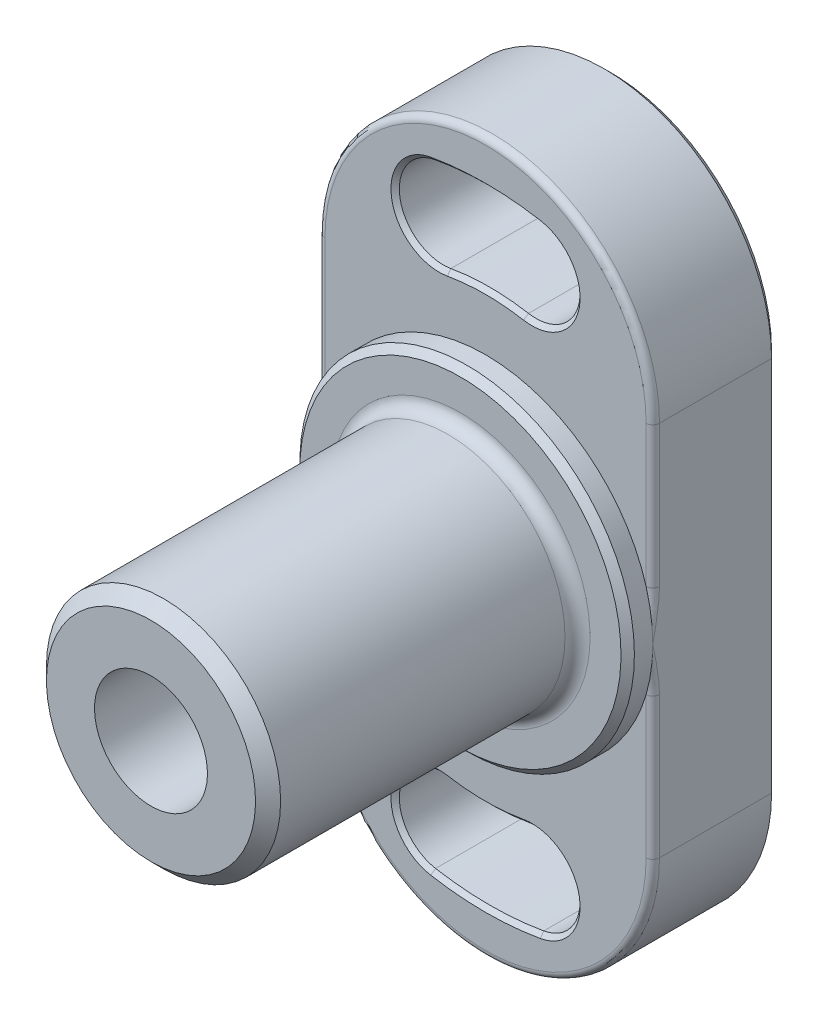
ISO-10303-21;
HEADER;
FILE_DESCRIPTION(('STEP AP214'),'2;1');
FILE_NAME('part.step','',(''),(''),'','','');
FILE_SCHEMA(('AUTOMOTIVE_DESIGN { 1 0 10303 214 1 1 1 1 }'));
ENDSEC;
DATA;
#1=APPLICATION_CONTEXT('core data for automotive mechanical design processes');
#2=APPLICATION_PROTOCOL_DEFINITION('international standard','automotive_design',2000,#1);
#3=PRODUCT_CONTEXT('',#1,'mechanical');
#4=PRODUCT('Part','Part','',(#3));
#5=PRODUCT_RELATED_PRODUCT_CATEGORY('part','',(#4));
#6=PRODUCT_DEFINITION_FORMATION('','',#4);
#7=PRODUCT_DEFINITION_CONTEXT('part definition',#1,'design');
#8=PRODUCT_DEFINITION('design','',#6,#7);
#9=PRODUCT_DEFINITION_SHAPE('','',#8);
#10=(LENGTH_UNIT() NAMED_UNIT(*) SI_UNIT(.MILLI.,.METRE.));
#11=(NAMED_UNIT(*) PLANE_ANGLE_UNIT() SI_UNIT($,.RADIAN.));
#12=(NAMED_UNIT(*) SI_UNIT($,.STERADIAN.) SOLID_ANGLE_UNIT());
#13=UNCERTAINTY_MEASURE_WITH_UNIT(LENGTH_MEASURE(1.E-05),#10,'distance_accuracy_value','');
#14=(GEOMETRIC_REPRESENTATION_CONTEXT(3) GLOBAL_UNCERTAINTY_ASSIGNED_CONTEXT((#13)) GLOBAL_UNIT_ASSIGNED_CONTEXT((#10,
#11,#12)) REPRESENTATION_CONTEXT('',''));
#15=CARTESIAN_POINT('',(0.,0.,0.));
#16=DIRECTION('',(0.,0.,1.));
#17=DIRECTION('',(1.,0.,0.));
#18=AXIS2_PLACEMENT_3D('',#15,#16,#17);
#19=CARTESIAN_POINT('',(0.,22.5,15.));
#20=DIRECTION('',(0.,0.,1.));
#21=DIRECTION('',(0.,-1.,0.));
#22=AXIS2_PLACEMENT_3D('',#19,#20,#21);
#23=PLANE('',#22);
#24=CARTESIAN_POINT('',(-5.55674168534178,31.5138480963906,15.));
#25=DIRECTION('',(0.,0.,1.));
#26=DIRECTION('',(0.,-1.,0.));
#27=AXIS2_PLACEMENT_3D('',#24,#25,#26);
#28=CIRCLE('',#27,5.75);
#29=CARTESIAN_POINT('',(-4.55826466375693,25.8512035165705,15.));
#30=VERTEX_POINT('',#29);
#31=CARTESIAN_POINT('',(-6.55521870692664,37.1764926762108,15.));
#32=VERTEX_POINT('',#31);
#33=EDGE_CURVE('E1088',#30,#32,#28,.F.);
#34=ORIENTED_EDGE('',*,*,#33,.T.);
#35=CARTESIAN_POINT('',(0.,0.,15.));
#36=DIRECTION('',(0.,0.,1.));
#37=DIRECTION('',(0.,-1.,0.));
#38=AXIS2_PLACEMENT_3D('',#35,#36,#37);
#39=CIRCLE('',#38,37.75);
#40=CARTESIAN_POINT('',(6.55521870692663,37.1764926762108,15.));
#41=VERTEX_POINT('',#40);
#42=EDGE_CURVE('E1090',#32,#41,#39,.F.);
#43=ORIENTED_EDGE('',*,*,#42,.T.);
#44=CARTESIAN_POINT('',(5.55674168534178,31.5138480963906,15.));
#45=DIRECTION('',(0.,0.,1.));
#46=DIRECTION('',(0.,-1.,0.));
#47=AXIS2_PLACEMENT_3D('',#44,#45,#46);
#48=CIRCLE('',#47,5.75);
#49=CARTESIAN_POINT('',(4.55826466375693,25.8512035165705,15.));
#50=VERTEX_POINT('',#49);
#51=EDGE_CURVE('E1086',#41,#50,#48,.F.);
#52=ORIENTED_EDGE('',*,*,#51,.T.);
#53=CARTESIAN_POINT('',(0.,0.,15.));
#54=DIRECTION('',(0.,0.,1.));
#55=DIRECTION('',(0.,-1.,0.));
#56=AXIS2_PLACEMENT_3D('',#53,#54,#55);
#57=CIRCLE('',#56,26.25);
#58=EDGE_CURVE('E1084',#50,#30,#57,.T.);
#59=ORIENTED_EDGE('',*,*,#58,.T.);
#60=EDGE_LOOP('',(#34,#43,#52,#59));
#61=FACE_BOUND('',#60,.T.);
#62=CARTESIAN_POINT('',(0.,0.,15.));
#63=DIRECTION('',(0.,0.,-1.));
#64=DIRECTION('',(0.,1.,0.));
#65=AXIS2_PLACEMENT_3D('',#62,#63,#64);
#66=CIRCLE('',#65,20.);
#67=CARTESIAN_POINT('',(-19.2,5.6,15.));
#68=VERTEX_POINT('',#67);
#69=CARTESIAN_POINT('',(19.2,5.6,15.));
#70=VERTEX_POINT('',#69);
#71=EDGE_CURVE('E242',#68,#70,#66,.T.);
#72=ORIENTED_EDGE('',*,*,#71,.T.);
#73=DIRECTION('',(0.,1.,0.));
#74=VECTOR('',#73,1.);
#75=CARTESIAN_POINT('',(19.2,22.5,15.));
#76=LINE('',#75,#74);
#77=CARTESIAN_POINT('',(19.2,22.5,15.));
#78=VERTEX_POINT('',#77);
#79=EDGE_CURVE('E248',#70,#78,#76,.T.);
#80=ORIENTED_EDGE('',*,*,#79,.T.);
#81=CARTESIAN_POINT('',(0.,22.5,15.));
#82=DIRECTION('',(0.,0.,1.));
#83=DIRECTION('',(0.,-1.,0.));
#84=AXIS2_PLACEMENT_3D('',#81,#82,#83);
#85=CIRCLE('',#84,19.2);
#86=CARTESIAN_POINT('',(-19.2,22.5,15.));
#87=VERTEX_POINT('',#86);
#88=EDGE_CURVE('E532',#78,#87,#85,.T.);
#89=ORIENTED_EDGE('',*,*,#88,.T.);
#90=DIRECTION('',(0.,-1.,0.));
#91=VECTOR('',#90,1.);
#92=CARTESIAN_POINT('',(-19.2,0.,15.));
#93=LINE('',#92,#91);
#94=EDGE_CURVE('E524',#87,#68,#93,.T.);
#95=ORIENTED_EDGE('',*,*,#94,.T.);
#96=EDGE_LOOP('',(#72,#80,#89,#95));
#97=FACE_BOUND('',#96,.T.);
#98=ADVANCED_FACE('F14',(#61,#97),#23,.T.);
#99=CARTESIAN_POINT('',(5.55674168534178,-31.5138480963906,15.));
#100=DIRECTION('',(0.,0.,1.));
#101=DIRECTION('',(0.,-1.,0.));
#102=AXIS2_PLACEMENT_3D('',#99,#100,#101);
#103=CIRCLE('',#102,5.75);
#104=CARTESIAN_POINT('',(4.55826466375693,-25.8512035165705,15.));
#105=VERTEX_POINT('',#104);
#106=CARTESIAN_POINT('',(6.55521870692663,-37.1764926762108,15.));
#107=VERTEX_POINT('',#106);
#108=EDGE_CURVE('E1114',#105,#107,#103,.F.);
#109=ORIENTED_EDGE('',*,*,#108,.T.);
#110=CARTESIAN_POINT('',(0.,0.,15.));
#111=DIRECTION('',(0.,0.,1.));
#112=DIRECTION('',(0.,-1.,0.));
#113=AXIS2_PLACEMENT_3D('',#110,#111,#112);
#114=CIRCLE('',#113,37.75);
#115=CARTESIAN_POINT('',(-6.55521870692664,-37.1764926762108,15.));
#116=VERTEX_POINT('',#115);
#117=EDGE_CURVE('E1116',#107,#116,#114,.F.);
#118=ORIENTED_EDGE('',*,*,#117,.T.);
#119=CARTESIAN_POINT('',(-5.55674168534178,-31.5138480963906,15.));
#120=DIRECTION('',(0.,0.,1.));
#121=DIRECTION('',(0.,-1.,0.));
#122=AXIS2_PLACEMENT_3D('',#119,#120,#121);
#123=CIRCLE('',#122,5.75);
#124=CARTESIAN_POINT('',(-4.55826466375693,-25.8512035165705,15.));
#125=VERTEX_POINT('',#124);
#126=EDGE_CURVE('E1112',#116,#125,#123,.F.);
#127=ORIENTED_EDGE('',*,*,#126,.T.);
#128=CARTESIAN_POINT('',(0.,0.,15.));
#129=DIRECTION('',(0.,0.,1.));
#130=DIRECTION('',(0.,-1.,0.));
#131=AXIS2_PLACEMENT_3D('',#128,#129,#130);
#132=CIRCLE('',#131,26.25);
#133=EDGE_CURVE('E1110',#125,#105,#132,.T.);
#134=ORIENTED_EDGE('',*,*,#133,.T.);
#135=EDGE_LOOP('',(#109,#118,#127,#134));
#136=FACE_BOUND('',#135,.T.);
#137=CARTESIAN_POINT('',(0.,-22.5,15.));
#138=DIRECTION('',(0.,0.,1.));
#139=DIRECTION('',(0.,-1.,0.));
#140=AXIS2_PLACEMENT_3D('',#137,#138,#139);
#141=CIRCLE('',#140,19.2);
#142=CARTESIAN_POINT('',(-19.2,-22.5,15.));
#143=VERTEX_POINT('',#142);
#144=CARTESIAN_POINT('',(19.2,-22.5,15.));
#145=VERTEX_POINT('',#144);
#146=EDGE_CURVE('E564',#143,#145,#141,.T.);
#147=ORIENTED_EDGE('',*,*,#146,.T.);
#148=DIRECTION('',(0.,1.,0.));
#149=VECTOR('',#148,1.);
#150=CARTESIAN_POINT('',(19.2,0.,15.));
#151=LINE('',#150,#149);
#152=CARTESIAN_POINT('',(19.2,-5.6,15.));
#153=VERTEX_POINT('',#152);
#154=EDGE_CURVE('E562',#145,#153,#151,.T.);
#155=ORIENTED_EDGE('',*,*,#154,.T.);
#156=CARTESIAN_POINT('',(-19.2,-5.6,15.));
#157=VERTEX_POINT('',#156);
#158=EDGE_CURVE('E231',#153,#157,#66,.T.);
#159=ORIENTED_EDGE('',*,*,#158,.T.);
#160=DIRECTION('',(0.,-1.,0.));
#161=VECTOR('',#160,1.);
#162=CARTESIAN_POINT('',(-19.2,-22.5,15.));
#163=LINE('',#162,#161);
#164=EDGE_CURVE('E566',#157,#143,#163,.T.);
#165=ORIENTED_EDGE('',*,*,#164,.T.);
#166=EDGE_LOOP('',(#147,#155,#159,#165));
#167=FACE_BOUND('',#166,.T.);
#168=ADVANCED_FACE('F431',(#136,#167),#23,.T.);
#169=CARTESIAN_POINT('',(0.,22.5,0.));
#170=DIRECTION('',(0.,0.,1.));
#171=DIRECTION('',(0.,-1.,0.));
#172=AXIS2_PLACEMENT_3D('',#169,#170,#171);
#173=PLANE('',#172);
#174=CARTESIAN_POINT('',(5.55674168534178,31.5138480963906,0.));
#175=DIRECTION('',(0.,0.,1.));
#176=DIRECTION('',(0.,-1.,0.));
#177=AXIS2_PLACEMENT_3D('',#174,#175,#176);
#178=CIRCLE('',#177,5.75);
#179=CARTESIAN_POINT('',(4.55826466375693,25.8512035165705,0.));
#180=VERTEX_POINT('',#179);
#181=CARTESIAN_POINT('',(6.55521870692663,37.1764926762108,0.));
#182=VERTEX_POINT('',#181);
#183=EDGE_CURVE('E37',#180,#182,#178,.T.);
#184=ORIENTED_EDGE('',*,*,#183,.T.);
#185=CARTESIAN_POINT('',(0.,0.,0.));
#186=DIRECTION('',(0.,0.,1.));
#187=DIRECTION('',(0.,-1.,0.));
#188=AXIS2_PLACEMENT_3D('',#185,#186,#187);
#189=CIRCLE('',#188,37.75);
#190=CARTESIAN_POINT('',(-6.55521870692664,37.1764926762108,0.));
#191=VERTEX_POINT('',#190);
#192=EDGE_CURVE('E664',#182,#191,#189,.T.);
#193=ORIENTED_EDGE('',*,*,#192,.T.);
#194=CARTESIAN_POINT('',(-5.55674168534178,31.5138480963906,0.));
#195=DIRECTION('',(0.,0.,1.));
#196=DIRECTION('',(0.,-1.,0.));
#197=AXIS2_PLACEMENT_3D('',#194,#195,#196);
#198=CIRCLE('',#197,5.75);
#199=CARTESIAN_POINT('',(-4.55826466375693,25.8512035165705,0.));
#200=VERTEX_POINT('',#199);
#201=EDGE_CURVE('E637',#191,#200,#198,.T.);
#202=ORIENTED_EDGE('',*,*,#201,.T.);
#203=CARTESIAN_POINT('',(0.,0.,0.));
#204=DIRECTION('',(0.,0.,1.));
#205=DIRECTION('',(0.,-1.,0.));
#206=AXIS2_PLACEMENT_3D('',#203,#204,#205);
#207=CIRCLE('',#206,26.25);
#208=EDGE_CURVE('E1138',#200,#180,#207,.F.);
#209=ORIENTED_EDGE('',*,*,#208,.T.);
#210=EDGE_LOOP('',(#184,#193,#202,#209));
#211=FACE_BOUND('',#210,.T.);
#212=CARTESIAN_POINT('',(-5.55674168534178,-31.5138480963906,0.));
#213=DIRECTION('',(0.,0.,1.));
#214=DIRECTION('',(0.,-1.,0.));
#215=AXIS2_PLACEMENT_3D('',#212,#213,#214);
#216=CIRCLE('',#215,5.75);
#217=CARTESIAN_POINT('',(-4.55826466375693,-25.8512035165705,0.));
#218=VERTEX_POINT('',#217);
#219=CARTESIAN_POINT('',(-6.55521870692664,-37.1764926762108,0.));
#220=VERTEX_POINT('',#219);
#221=EDGE_CURVE('E1047',#218,#220,#216,.T.);
#222=ORIENTED_EDGE('',*,*,#221,.T.);
#223=CARTESIAN_POINT('',(0.,0.,0.));
#224=DIRECTION('',(0.,0.,1.));
#225=DIRECTION('',(0.,-1.,0.));
#226=AXIS2_PLACEMENT_3D('',#223,#224,#225);
#227=CIRCLE('',#226,37.75);
#228=CARTESIAN_POINT('',(6.55521870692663,-37.1764926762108,0.));
#229=VERTEX_POINT('',#228);
#230=EDGE_CURVE('E1136',#220,#229,#227,.T.);
#231=ORIENTED_EDGE('',*,*,#230,.T.);
#232=CARTESIAN_POINT('',(5.55674168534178,-31.5138480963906,0.));
#233=DIRECTION('',(0.,0.,1.));
#234=DIRECTION('',(0.,-1.,0.));
#235=AXIS2_PLACEMENT_3D('',#232,#233,#234);
#236=CIRCLE('',#235,5.75);
#237=CARTESIAN_POINT('',(4.55826466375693,-25.8512035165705,0.));
#238=VERTEX_POINT('',#237);
#239=EDGE_CURVE('E1134',#229,#238,#236,.T.);
#240=ORIENTED_EDGE('',*,*,#239,.T.);
#241=CARTESIAN_POINT('',(0.,0.,0.));
#242=DIRECTION('',(0.,0.,1.));
#243=DIRECTION('',(0.,-1.,0.));
#244=AXIS2_PLACEMENT_3D('',#241,#242,#243);
#245=CIRCLE('',#244,26.25);
#246=EDGE_CURVE('E1131',#238,#218,#245,.F.);
#247=ORIENTED_EDGE('',*,*,#246,.T.);
#248=EDGE_LOOP('',(#222,#231,#240,#247));
#249=FACE_BOUND('',#248,.T.);
#250=CARTESIAN_POINT('',(0.,22.5,0.));
#251=DIRECTION('',(0.,0.,1.));
#252=DIRECTION('',(0.,-1.,0.));
#253=AXIS2_PLACEMENT_3D('',#250,#251,#252);
#254=CIRCLE('',#253,19.2);
#255=CARTESIAN_POINT('',(-19.2,22.5,0.));
#256=VERTEX_POINT('',#255);
#257=CARTESIAN_POINT('',(19.2,22.5,0.));
#258=VERTEX_POINT('',#257);
#259=EDGE_CURVE('E1052',#256,#258,#254,.F.);
#260=ORIENTED_EDGE('',*,*,#259,.T.);
#261=DIRECTION('',(0.,-1.,0.));
#262=VECTOR('',#261,1.);
#263=CARTESIAN_POINT('',(19.2,22.5,0.));
#264=LINE('',#263,#262);
#265=CARTESIAN_POINT('',(19.2,-22.5,0.));
#266=VERTEX_POINT('',#265);
#267=EDGE_CURVE('E1056',#258,#266,#264,.T.);
#268=ORIENTED_EDGE('',*,*,#267,.T.);
#269=CARTESIAN_POINT('',(0.,-22.5,0.));
#270=DIRECTION('',(0.,0.,1.));
#271=DIRECTION('',(0.,-1.,0.));
#272=AXIS2_PLACEMENT_3D('',#269,#270,#271);
#273=CIRCLE('',#272,19.2);
#274=CARTESIAN_POINT('',(-19.2,-22.5,0.));
#275=VERTEX_POINT('',#274);
#276=EDGE_CURVE('E1061',#266,#275,#273,.F.);
#277=ORIENTED_EDGE('',*,*,#276,.T.);
#278=DIRECTION('',(0.,1.,0.));
#279=VECTOR('',#278,1.);
#280=CARTESIAN_POINT('',(-19.2,22.5,0.));
#281=LINE('',#280,#279);
#282=EDGE_CURVE('E538',#275,#256,#281,.T.);
#283=ORIENTED_EDGE('',*,*,#282,.T.);
#284=EDGE_LOOP('',(#260,#268,#277,#283));
#285=FACE_BOUND('',#284,.T.);
#286=CARTESIAN_POINT('',(0.,0.,0.));
#287=DIRECTION('',(0.,0.,-1.));
#288=DIRECTION('',(0.,1.,0.));
#289=AXIS2_PLACEMENT_3D('',#286,#287,#288);
#290=CIRCLE('',#289,6.75);
#291=CARTESIAN_POINT('',(0.,6.75,0.));
#292=VERTEX_POINT('',#291);
#293=EDGE_CURVE('E235',#292,#292,#290,.T.);
#294=ORIENTED_EDGE('',*,*,#293,.F.);
#295=EDGE_LOOP('',(#294));
#296=FACE_BOUND('',#295,.T.);
#297=ADVANCED_FACE('F272',(#211,#249,#285,#296),#173,.F.);
#298=CARTESIAN_POINT('',(0.,22.5,15.));
#299=DIRECTION('',(0.,0.,-1.));
#300=DIRECTION('',(0.,1.,0.));
#301=AXIS2_PLACEMENT_3D('',#298,#299,#300);
#302=CYLINDRICAL_SURFACE('',#301,20.);
#303=DIRECTION('',(0.,0.,-1.));
#304=VECTOR('',#303,1.);
#305=CARTESIAN_POINT('',(20.,22.5,15.));
#306=LINE('',#305,#304);
#307=CARTESIAN_POINT('',(20.,22.5,14.2));
#308=VERTEX_POINT('',#307);
#309=CARTESIAN_POINT('',(20.,22.5,0.799999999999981));
#310=VERTEX_POINT('',#309);
#311=EDGE_CURVE('E576',#308,#310,#306,.T.);
#312=ORIENTED_EDGE('',*,*,#311,.T.);
#313=CARTESIAN_POINT('',(0.,22.5,0.799999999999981));
#314=DIRECTION('',(0.,0.,1.));
#315=DIRECTION('',(0.,-1.,0.));
#316=AXIS2_PLACEMENT_3D('',#313,#314,#315);
#317=CIRCLE('',#316,20.);
#318=CARTESIAN_POINT('',(-20.,22.5,0.799999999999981));
#319=VERTEX_POINT('',#318);
#320=EDGE_CURVE('E1068',#310,#319,#317,.T.);
#321=ORIENTED_EDGE('',*,*,#320,.T.);
#322=DIRECTION('',(0.,0.,-1.));
#323=VECTOR('',#322,1.);
#324=CARTESIAN_POINT('',(-20.,22.5,15.));
#325=LINE('',#324,#323);
#326=CARTESIAN_POINT('',(-20.,22.5,14.2));
#327=VERTEX_POINT('',#326);
#328=EDGE_CURVE('E578',#327,#319,#325,.T.);
#329=ORIENTED_EDGE('',*,*,#328,.F.);
#330=CARTESIAN_POINT('',(0.,22.5,14.2));
#331=DIRECTION('',(0.,0.,1.));
#332=DIRECTION('',(0.,-1.,0.));
#333=AXIS2_PLACEMENT_3D('',#330,#331,#332);
#334=CIRCLE('',#333,20.);
#335=EDGE_CURVE('E491',#327,#308,#334,.F.);
#336=ORIENTED_EDGE('',*,*,#335,.T.);
#337=EDGE_LOOP('',(#312,#321,#329,#336));
#338=FACE_BOUND('',#337,.T.);
#339=ADVANCED_FACE('F751',(#338),#302,.T.);
#340=CARTESIAN_POINT('',(-20.,22.5,15.));
#341=DIRECTION('',(1.,0.,0.));
#342=DIRECTION('',(0.,1.,0.));
#343=AXIS2_PLACEMENT_3D('',#340,#341,#342);
#344=PLANE('',#343);
#345=ORIENTED_EDGE('',*,*,#328,.T.);
#346=DIRECTION('',(0.,-1.,0.));
#347=VECTOR('',#346,1.);
#348=CARTESIAN_POINT('',(-20.,22.5,0.799999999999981));
#349=LINE('',#348,#347);
#350=CARTESIAN_POINT('',(-20.,-22.5,0.799999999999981));
#351=VERTEX_POINT('',#350);
#352=EDGE_CURVE('E632',#319,#351,#349,.T.);
#353=ORIENTED_EDGE('',*,*,#352,.T.);
#354=DIRECTION('',(0.,0.,-1.));
#355=VECTOR('',#354,1.);
#356=CARTESIAN_POINT('',(-20.,-22.5,15.));
#357=LINE('',#356,#355);
#358=CARTESIAN_POINT('',(-20.,-22.5,14.2));
#359=VERTEX_POINT('',#358);
#360=EDGE_CURVE('E575',#359,#351,#357,.T.);
#361=ORIENTED_EDGE('',*,*,#360,.F.);
#362=DIRECTION('',(0.,-1.,0.));
#363=VECTOR('',#362,1.);
#364=CARTESIAN_POINT('',(-20.,0.,14.2));
#365=LINE('',#364,#363);
#366=CARTESIAN_POINT('',(-20.,-5.6,14.2));
#367=VERTEX_POINT('',#366);
#368=EDGE_CURVE('E536',#359,#367,#365,.F.);
#369=ORIENTED_EDGE('',*,*,#368,.T.);
#370=CARTESIAN_POINT('',(-18.6952698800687,-7.10541231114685,15.));
#371=CARTESIAN_POINT('',(-19.0873367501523,-7.00687599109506,15.3032137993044));
#372=CARTESIAN_POINT('',(-19.5436683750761,-7.07396890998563,15.0967569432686));
#373=CARTESIAN_POINT('',(-20.,-7.1410618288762,14.8903000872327));
#374=CARTESIAN_POINT('',(-20.,-7.29724243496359,14.4097045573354));
#375=CARTESIAN_POINT('',(-18.7053348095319,-7.07893052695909,15.));
#376=CARTESIAN_POINT('',(-19.0990203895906,-6.98697142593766,15.2956547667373));
#377=CARTESIAN_POINT('',(-19.5495248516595,-7.05204468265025,15.0867001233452));
#378=CARTESIAN_POINT('',(-20.,-7.1172320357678,14.8777966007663));
#379=CARTESIAN_POINT('',(-20.,-7.26611696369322,14.3995941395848));
#380=CARTESIAN_POINT('',(-18.7154165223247,-7.0522344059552,15.));
#381=CARTESIAN_POINT('',(-19.1104595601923,-6.96619998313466,15.2880608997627));
#382=CARTESIAN_POINT('',(-19.55524321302,-7.02935708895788,15.0768369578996));
#383=CARTESIAN_POINT('',(-20.,-7.09262732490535,14.8656595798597));
#384=CARTESIAN_POINT('',(-20.,-7.23481535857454,14.3900440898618));
#385=CARTESIAN_POINT('',(-18.7355878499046,-6.9984691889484,15.));
#386=CARTESIAN_POINT('',(-19.1328209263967,-6.92327660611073,15.2729430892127));
#387=CARTESIAN_POINT('',(-19.5664239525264,-6.98270040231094,15.0575407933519));
#388=CARTESIAN_POINT('',(-20.,-7.04223576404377,14.8421848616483));
#389=CARTESIAN_POINT('',(-20.,-7.17192825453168,14.3719563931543));
#390=CARTESIAN_POINT('',(-18.7456774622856,-6.97140018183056,15.));
#391=CARTESIAN_POINT('',(-19.143748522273,-6.90112622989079,15.2654168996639));
#392=CARTESIAN_POINT('',(-19.5718863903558,-6.95873161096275,15.0481076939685));
#393=CARTESIAN_POINT('',(-20.,-7.01644853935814,14.8308402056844));
#394=CARTESIAN_POINT('',(-20.,-7.14034282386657,14.3634185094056));
#395=CARTESIAN_POINT('',(-18.7759059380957,-6.88975480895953,15.));
#396=CARTESIAN_POINT('',(-19.1757296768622,-6.83316422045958,15.2431464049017));
#397=CARTESIAN_POINT('',(-19.5879131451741,-6.88530567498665,15.0205298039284));
#398=CARTESIAN_POINT('',(-20.,-6.93788895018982,14.7980794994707));
#399=CARTESIAN_POINT('',(-20.,-7.04530675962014,14.3391707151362));
#400=CARTESIAN_POINT('',(-18.7960253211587,-6.8346852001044,15.));
#401=CARTESIAN_POINT('',(-19.1961775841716,-6.78549107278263,15.2285788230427));
#402=CARTESIAN_POINT('',(-19.598128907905,-6.83428270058,15.0030854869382));
#403=CARTESIAN_POINT('',(-20.,-6.88350212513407,14.7777266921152));
#404=CARTESIAN_POINT('',(-20.,-6.98151182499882,14.3248062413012));
#405=CARTESIAN_POINT('',(-18.8360143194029,-6.72369200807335,15.));
#406=CARTESIAN_POINT('',(-19.2353884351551,-6.68704171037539,15.2004717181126));
#407=CARTESIAN_POINT('',(-19.6177336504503,-6.72947405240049,14.9701592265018));
#408=CARTESIAN_POINT('',(-20.,-6.77232913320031,14.7399793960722));
#409=CARTESIAN_POINT('',(-20.,-6.85355238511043,14.299082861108));
#410=CARTESIAN_POINT('',(-18.8558845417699,-6.66777186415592,15.));
#411=CARTESIAN_POINT('',(-19.2541837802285,-6.63626709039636,15.1869110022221));
#412=CARTESIAN_POINT('',(-19.6271252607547,-6.67569810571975,14.9546709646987));
#413=CARTESIAN_POINT('',(-20.,-6.71553227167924,14.7225386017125));
#414=CARTESIAN_POINT('',(-20.,-6.78938980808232,14.287714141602));
#415=CARTESIAN_POINT('',(-18.8953685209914,-6.55504524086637,15.));
#416=CARTESIAN_POINT('',(-19.2903927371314,-6.53225072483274,15.1608598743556));
#417=CARTESIAN_POINT('',(-19.6452292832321,-6.5659659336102,14.9254935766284));
#418=CARTESIAN_POINT('',(-20.,-6.60008151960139,14.6902332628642));
#419=CARTESIAN_POINT('',(-20.,-6.66065848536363,14.267469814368));
#420=CARTESIAN_POINT('',(-18.9149821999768,-6.49823850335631,15.));
#421=CARTESIAN_POINT('',(-19.3078274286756,-6.47899333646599,15.1483537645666));
#422=CARTESIAN_POINT('',(-19.6539414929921,-6.51000906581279,14.9118049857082));
#423=CARTESIAN_POINT('',(-20.,-6.54140411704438,14.6753405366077));
#424=CARTESIAN_POINT('',(-20.,-6.59608962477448,14.2585949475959));
#425=CARTESIAN_POINT('',(-18.9729315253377,-6.32788628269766,15.));
#426=CARTESIAN_POINT('',(-19.3578023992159,-6.31805422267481,15.1128469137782));
#427=CARTESIAN_POINT('',(-19.6790110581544,-6.34088790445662,14.8735280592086));
#428=CARTESIAN_POINT('',(-20.,-6.36519494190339,14.634545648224));
#429=CARTESIAN_POINT('',(-20.,-6.40335908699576,14.2353472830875));
#430=CARTESIAN_POINT('',(-19.0107995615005,-6.21323355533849,15.));
#431=CARTESIAN_POINT('',(-19.388842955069,-6.20699479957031,15.0912494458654));
#432=CARTESIAN_POINT('',(-19.6945038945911,-6.22534321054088,14.8513868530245));
#433=CARTESIAN_POINT('',(-20.,-6.24500725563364,14.6117445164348));
#434=CARTESIAN_POINT('',(-20.,-6.27481866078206,14.224096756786));
#435=CARTESIAN_POINT('',(-19.0849958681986,-5.98145260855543,15.));
#436=CARTESIAN_POINT('',(-19.4471393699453,-5.98006431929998,15.0521003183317));
#437=CARTESIAN_POINT('',(-19.7236495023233,-5.99020744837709,14.8126917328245));
#438=CARTESIAN_POINT('',(-20.,-6.00165249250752,14.5734936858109));
#439=CARTESIAN_POINT('',(-20.,-6.0172451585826,14.2081095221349));
#440=CARTESIAN_POINT('',(-19.1213225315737,-5.86432198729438,15.));
#441=CARTESIAN_POINT('',(-19.474479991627,-5.86405907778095,15.0344766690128));
#442=CARTESIAN_POINT('',(-19.737300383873,-5.87061237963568,14.7961435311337));
#443=CARTESIAN_POINT('',(-20.,-5.87831967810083,14.5579396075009));
#444=CARTESIAN_POINT('',(-20.,-5.88821171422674,14.203379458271));
#445=CARTESIAN_POINT('',(-19.2226966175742,-5.52634994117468,15.));
#446=CARTESIAN_POINT('',(-19.5478927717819,-5.52895059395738,14.989450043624));
#447=CARTESIAN_POINT('',(-19.7741599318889,-5.52477378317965,14.7555982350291));
#448=CARTESIAN_POINT('',(-20.,-5.52456603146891,14.5222229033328));
#449=CARTESIAN_POINT('',(-20.,-5.519002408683,14.1973585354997));
#450=CARTESIAN_POINT('',(-19.2855626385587,-5.30298772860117,15.));
#451=CARTESIAN_POINT('',(-19.5907022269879,-5.30388442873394,14.9660745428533));
#452=CARTESIAN_POINT('',(-19.7954863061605,-5.29530633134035,14.7374428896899));
#453=CARTESIAN_POINT('',(-20.,-5.2899205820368,14.5089876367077));
#454=CARTESIAN_POINT('',(-20.,-5.27872332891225,14.2025285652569));
#455=CARTESIAN_POINT('',(-19.4042990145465,-4.85056363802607,15.));
#456=CARTESIAN_POINT('',(-19.667948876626,-4.84770947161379,14.9294233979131));
#457=CARTESIAN_POINT('',(-19.8341027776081,-4.83166809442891,14.7134478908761));
#458=CARTESIAN_POINT('',(-20.,-4.81876172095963,14.4976235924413));
#459=CARTESIAN_POINT('',(-20.,-4.79875836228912,14.225786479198));
#460=CARTESIAN_POINT('',(-19.4601650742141,-4.6214983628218,15.));
#461=CARTESIAN_POINT('',(-19.7026139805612,-4.6159693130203,14.915960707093));
#462=CARTESIAN_POINT('',(-19.8513904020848,-4.59749452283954,14.7076157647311));
#463=CARTESIAN_POINT('',(-20.,-4.58153988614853,14.4992826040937));
#464=CARTESIAN_POINT('',(-20.,-4.55907292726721,14.2438822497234));
#465=CARTESIAN_POINT('',(-19.5643476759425,-4.15844495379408,15.));
#466=CARTESIAN_POINT('',(-19.7650940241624,-4.14852753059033,14.8969647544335));
#467=CARTESIAN_POINT('',(-19.8826299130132,-4.12620289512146,14.7053830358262));
#468=CARTESIAN_POINT('',(-20.,-4.10637625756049,14.5138133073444));
#469=CARTESIAN_POINT('',(-20.,-4.08036417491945,14.2897474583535));
#470=CARTESIAN_POINT('',(-19.6126550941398,-3.92445125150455,15.));
#471=CARTESIAN_POINT('',(-19.7930498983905,-3.91228869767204,14.8913338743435));
#472=CARTESIAN_POINT('',(-19.8965777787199,-3.88908164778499,14.7089937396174));
#473=CARTESIAN_POINT('',(-20.,-3.8678574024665,14.5265978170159));
#474=CARTESIAN_POINT('',(-20.,-3.84134199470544,14.3175284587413));
#475=CARTESIAN_POINT('',(-19.7011961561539,-3.45261455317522,15.));
#476=CARTESIAN_POINT('',(-19.8429952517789,-3.43745078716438,14.8862749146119));
#477=CARTESIAN_POINT('',(-19.9215480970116,-3.41324026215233,14.7234521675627));
#478=CARTESIAN_POINT('',(-20.,-3.39098373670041,14.560565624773));
#479=CARTESIAN_POINT('',(-20.,-3.36424376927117,14.3803692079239));
#480=CARTESIAN_POINT('',(-19.7414285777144,-3.21477098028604,15.));
#481=CARTESIAN_POINT('',(-19.8650834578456,-3.19838934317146,14.8867917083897));
#482=CARTESIAN_POINT('',(-19.9325701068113,-3.17451988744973,14.7343009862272));
#483=CARTESIAN_POINT('',(-20.,-3.1521441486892,14.5817156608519));
#484=CARTESIAN_POINT('',(-20.,-3.12616787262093,14.4154300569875));
#485=CARTESIAN_POINT('',(-19.8500997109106,-2.49235468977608,15.));
#486=CARTESIAN_POINT('',(-19.923472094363,-2.47709629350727,14.8954289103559));
#487=CARTESIAN_POINT('',(-19.9618641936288,-2.45268584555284,14.7751866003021));
#488=CARTESIAN_POINT('',(-20.,-2.43440040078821,14.6546173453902));
#489=CARTESIAN_POINT('',(-20.,-2.40897616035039,14.5293358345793));
#490=CARTESIAN_POINT('',(-19.9055618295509,-2.00308043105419,15.));
#491=CARTESIAN_POINT('',(-19.9521271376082,-1.9878732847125,14.9106730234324));
#492=CARTESIAN_POINT('',(-19.9760953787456,-1.96815693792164,14.8135140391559));
#493=CARTESIAN_POINT('',(-20.,-1.95140371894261,14.7161149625));
#494=CARTESIAN_POINT('',(-20.,-1.93119082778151,14.6164202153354));
#495=CARTESIAN_POINT('',(-19.9801390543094,-1.01865168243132,15.));
#496=CARTESIAN_POINT('',(-19.990090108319,-1.00993363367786,14.9501063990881));
#497=CARTESIAN_POINT('',(-19.9950700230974,-0.998329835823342,14.9002788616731));
#498=CARTESIAN_POINT('',(-20.,-0.989565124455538,14.8501724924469));
#499=CARTESIAN_POINT('',(-20.,-0.977984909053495,14.8004640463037));
#500=CARTESIAN_POINT('',(-19.9992793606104,-0.523501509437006,15.));
#501=CARTESIAN_POINT('',(-19.9996398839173,-0.518293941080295,14.9743539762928));
#502=CARTESIAN_POINT('',(-19.9998200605,-0.513032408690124,14.9487092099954));
#503=CARTESIAN_POINT('',(-19.9999999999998,-0.507823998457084,14.9230591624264));
#504=CARTESIAN_POINT('',(-20.,-0.502562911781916,14.8974166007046));
#505=CARTESIAN_POINT('',(-19.9999866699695,-0.023569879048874,15.));
#506=CARTESIAN_POINT('',(-19.9999933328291,-0.0233341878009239,14.9988453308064));
#507=CARTESIAN_POINT('',(-19.999996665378,-0.0230984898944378,14.9976906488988));
#508=CARTESIAN_POINT('',(-20.,-0.0228627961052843,14.9965359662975));
#509=CARTESIAN_POINT('',(-20.,-0.0226270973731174,14.9953812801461));
#510=CARTESIAN_POINT('',(-19.9999916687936,-0.0188555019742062,15.));
#511=CARTESIAN_POINT('',(-19.99999583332,-0.0186669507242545,14.9990762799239));
#512=CARTESIAN_POINT('',(-19.9999979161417,-0.0184783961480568,14.9981525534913));
#513=CARTESIAN_POINT('',(-20.,-0.0182898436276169,14.997228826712));
#514=CARTESIAN_POINT('',(-20.,-0.0181012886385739,14.9963050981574));
#515=CARTESIAN_POINT('',(-19.999998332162,-0.00942741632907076,15.));
#516=CARTESIAN_POINT('',(-19.9999991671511,-0.00933314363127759,14.9995381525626));
#517=CARTESIAN_POINT('',(-19.9999995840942,-0.00923886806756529,14.9990763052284));
#518=CARTESIAN_POINT('',(-20.,-0.00914459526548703,14.9986144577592));
#519=CARTESIAN_POINT('',(-20.,-0.00905031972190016,14.9981526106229));
#520=CARTESIAN_POINT('',(-19.9999999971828,-0.00471370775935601,15.));
#521=CARTESIAN_POINT('',(-20.0000000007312,-0.00466657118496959,14.9997690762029));
#522=CARTESIAN_POINT('',(-20.0000000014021,-0.00461943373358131,14.9995381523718));
#523=CARTESIAN_POINT('',(-20.,-0.00457229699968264,14.9993072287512));
#524=CARTESIAN_POINT('',(-20.,-0.00452515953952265,14.9990763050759));
#525=CARTESIAN_POINT('',(-20.,0.,15.));
#526=CARTESIAN_POINT('',(-20.,0.,15.));
#527=CARTESIAN_POINT('',(-20.,0.,15.));
#528=CARTESIAN_POINT('',(-20.,0.,15.));
#529=CARTESIAN_POINT('',(-20.,0.,15.));
#530=(BOUNDED_SURFACE() B_SPLINE_SURFACE(3,2,((#370,#371,#372,#373,#374),(#375,#376,#377,#378,
#379),(#380,#381,#382,#383,#384),(#385,#386,#387,#388,#389),(#390,#391,#392,#393,#394),(#395,
#396,#397,#398,#399),(#400,#401,#402,#403,#404),(#405,#406,#407,#408,#409),(#410,#411,#412,#413,
#414),(#415,#416,#417,#418,#419),(#420,#421,#422,#423,#424),(#425,#426,#427,#428,#429),(#430,
#431,#432,#433,#434),(#435,#436,#437,#438,#439),(#440,#441,#442,#443,#444),(#445,#446,#447,#448,
#449),(#450,#451,#452,#453,#454),(#455,#456,#457,#458,#459),(#460,#461,#462,#463,#464),(#465,
#466,#467,#468,#469),(#470,#471,#472,#473,#474),(#475,#476,#477,#478,#479),(#480,#481,#482,#483,
#484),(#485,#486,#487,#488,#489),(#490,#491,#492,#493,#494),(#495,#496,#497,#498,#499),(#500,
#501,#502,#503,#504),(#505,#506,#507,#508,#509),(#510,#511,#512,#513,#514),(#515,#516,#517,#518,
#519),(#520,#521,#522,#523,#524),(#525,#526,#527,#528,#529)),.UNSPECIFIED.,.F.,.F.,
.F.) B_SPLINE_SURFACE_WITH_KNOTS((4,2,2,2,2,2,2,2,2,2,2,2,2,2,2,4),(3,2,3),(0.,
0.0981650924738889,0.196307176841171,0.392388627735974,0.587819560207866,0.783308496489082,
1.17015986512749,1.55740515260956,2.27784252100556,2.99871982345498,3.72046067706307,
4.44231069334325,5.8989606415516,7.35459959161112,7.36845698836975,7.38231240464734),(0.,0.5,
1.),.UNSPECIFIED.) GEOMETRIC_REPRESENTATION_ITEM() RATIONAL_B_SPLINE_SURFACE(((1.,
0.845454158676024,1.,0.845454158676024,1.),(1.,0.84761878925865,1.,0.84761878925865,1.),(1.,
0.849724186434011,1.,0.849724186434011,1.),(1.,0.853826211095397,1.,0.853826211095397,1.),(1.,
0.855822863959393,1.,0.855822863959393,1.),(1.,0.861661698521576,1.,0.861661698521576,1.),(1.,
0.865357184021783,1.,0.865357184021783,1.),(1.,0.87240810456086,1.,0.87240810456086,1.),(1.,
0.87576462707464,1.,0.87576462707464,1.),(1.,0.882201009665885,1.,0.882201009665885,1.),(1.,
0.885280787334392,1.,0.885280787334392,1.),(1.,0.8941009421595,1.,0.8941009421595,1.),(1.,
0.899494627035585,1.,0.899494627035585,1.),(1.,0.909563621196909,1.,0.909563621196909,1.),(1.,
0.914238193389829,1.,0.914238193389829,1.),(1.,0.92677795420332,1.,0.92677795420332,1.),(1.,
0.933927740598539,1.,0.933927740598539,1.),(1.,0.946759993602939,1.,0.946759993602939,1.),(1.,
0.952441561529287,1.,0.952441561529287,1.),(1.,0.962636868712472,1.,0.962636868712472,1.),(1.,
0.967149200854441,1.,0.967149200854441,1.),(1.,0.975183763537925,1.,0.975183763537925,1.),(1.,
0.978705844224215,1.,0.978705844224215,1.),(1.,0.988031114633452,1.,0.988031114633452,1.),(1.,
0.992506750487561,1.,0.992506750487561,1.),(1.,0.998462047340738,1.,0.998462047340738,1.),(1.,
0.999943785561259,1.,0.999943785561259,1.),(1.,0.999998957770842,1.,0.999998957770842,1.),(1.,
0.999999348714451,1.,0.999999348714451,1.),(1.,0.999999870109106,1.,0.999999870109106,1.),(1.,
1.00000000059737,1.,1.00000000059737,1.),(1.,1.,1.,1.,1.))) REPRESENTATION_ITEM('') SURFACE());
#531=CARTESIAN_POINT('',(-20.,-7.29724243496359,14.4097045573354));
#532=CARTESIAN_POINT('',(-20.,-7.26611696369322,14.3995941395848));
#533=CARTESIAN_POINT('',(-20.,-7.23481535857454,14.3900440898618));
#534=CARTESIAN_POINT('',(-20.,-7.17192825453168,14.3719563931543));
#535=CARTESIAN_POINT('',(-20.,-7.14034282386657,14.3634185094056));
#536=CARTESIAN_POINT('',(-20.,-7.04530675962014,14.3391707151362));
#537=CARTESIAN_POINT('',(-20.,-6.98151182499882,14.3248062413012));
#538=CARTESIAN_POINT('',(-20.,-6.85355238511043,14.299082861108));
#539=CARTESIAN_POINT('',(-20.,-6.78938980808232,14.287714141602));
#540=CARTESIAN_POINT('',(-20.,-6.66065848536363,14.267469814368));
#541=CARTESIAN_POINT('',(-20.,-6.59608962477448,14.2585949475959));
#542=CARTESIAN_POINT('',(-20.,-6.40335908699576,14.2353472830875));
#543=CARTESIAN_POINT('',(-20.,-6.27481866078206,14.224096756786));
#544=CARTESIAN_POINT('',(-20.,-6.0172451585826,14.2081095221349));
#545=CARTESIAN_POINT('',(-20.,-5.88821171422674,14.203379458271));
#546=CARTESIAN_POINT('',(-20.,-5.519002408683,14.1973585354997));
#547=CARTESIAN_POINT('',(-20.,-5.27872332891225,14.2025285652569));
#548=CARTESIAN_POINT('',(-20.,-4.79875836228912,14.225786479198));
#549=CARTESIAN_POINT('',(-20.,-4.55907292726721,14.2438822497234));
#550=CARTESIAN_POINT('',(-20.,-4.08036417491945,14.2897474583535));
#551=CARTESIAN_POINT('',(-20.,-3.84134199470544,14.3175284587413));
#552=CARTESIAN_POINT('',(-20.,-3.36424376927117,14.3803692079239));
#553=CARTESIAN_POINT('',(-20.,-3.12616787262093,14.4154300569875));
#554=CARTESIAN_POINT('',(-20.,-2.40897616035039,14.5293358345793));
#555=CARTESIAN_POINT('',(-20.,-1.93119082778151,14.6164202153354));
#556=CARTESIAN_POINT('',(-20.,-0.977984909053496,14.8004640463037));
#557=CARTESIAN_POINT('',(-20.,-0.502562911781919,14.8974166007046));
#558=CARTESIAN_POINT('',(-20.,-0.0226270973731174,14.9953812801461));
#559=CARTESIAN_POINT('',(-20.,-0.0181012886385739,14.9963050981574));
#560=CARTESIAN_POINT('',(-20.,-0.00905031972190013,14.9981526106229));
#561=CARTESIAN_POINT('',(-20.,-0.00452515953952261,14.9990763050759));
#562=CARTESIAN_POINT('',(-20.,0.,15.));
#563=B_SPLINE_CURVE_WITH_KNOTS('',3,(#531,#532,#533,#534,#535,#536,#537,#538,#539,#540,#541,
#542,#543,#544,#545,#546,#547,#548,#549,#550,#551,#552,#553,#554,#555,#556,#557,#558,#559,#560,
#561,#562),.UNSPECIFIED.,.F.,.F.,(4,2,2,2,2,2,2,2,2,2,2,2,2,2,2,4),(0.,0.0981650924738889,
0.196307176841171,0.392388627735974,0.587819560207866,0.783308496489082,1.17015986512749,
1.55740515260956,2.27784252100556,2.99871982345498,3.72046067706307,4.44231069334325,
5.8989606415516,7.35459959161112,7.36845698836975,7.38231240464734),.UNSPECIFIED.);
#564=CARTESIAN_POINT('',(-20.,0.,15.));
#565=VERTEX_POINT('',#564);
#566=EDGE_CURVE('E539',#367,#565,#563,.T.);
#567=ORIENTED_EDGE('',*,*,#566,.T.);
#568=CARTESIAN_POINT('',(-20.,7.29724243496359,14.4097045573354));
#569=CARTESIAN_POINT('',(-20.,7.14106183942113,14.8903000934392));
#570=CARTESIAN_POINT('',(-19.5436683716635,7.07396892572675,15.096756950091));
#571=CARTESIAN_POINT('',(-19.087336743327,7.00687601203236,15.3032138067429));
#572=CARTESIAN_POINT('',(-18.6952698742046,7.10541232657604,15.));
#573=CARTESIAN_POINT('',(-20.,7.26611696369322,14.3995941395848));
#574=CARTESIAN_POINT('',(-20.,7.11723203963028,14.8777966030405));
#575=CARTESIAN_POINT('',(-19.549524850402,7.05204468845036,15.0867001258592));
#576=CARTESIAN_POINT('',(-19.0990203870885,6.98697143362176,15.295654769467));
#577=CARTESIAN_POINT('',(-18.7053348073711,7.07893053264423,15.));
#578=CARTESIAN_POINT('',(-20.,7.23481535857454,14.3900440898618));
#579=CARTESIAN_POINT('',(-20.,7.09262732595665,14.8656595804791));
#580=CARTESIAN_POINT('',(-19.5552432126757,7.02935709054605,15.076836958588));
#581=CARTESIAN_POINT('',(-19.1104595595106,6.96619998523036,15.2880609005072));
#582=CARTESIAN_POINT('',(-18.7154165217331,7.05223440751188,15.));
#583=CARTESIAN_POINT('',(-20.,7.17192825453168,14.3719563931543));
#584=CARTESIAN_POINT('',(-20.,7.04223576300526,14.8421848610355));
#585=CARTESIAN_POINT('',(-19.5664239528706,6.98270040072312,15.0575407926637));
#586=CARTESIAN_POINT('',(-19.1328209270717,6.92327660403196,15.2729430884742));
#587=CARTESIAN_POINT('',(-18.7355878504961,6.99846918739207,15.));
#588=CARTESIAN_POINT('',(-20.,7.14034282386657,14.3634185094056));
#589=CARTESIAN_POINT('',(-20.,7.01644853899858,14.830840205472));
#590=CARTESIAN_POINT('',(-19.5718863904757,6.95873161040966,15.0481076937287));
#591=CARTESIAN_POINT('',(-19.143748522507,6.90112622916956,15.2654168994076));
#592=CARTESIAN_POINT('',(-18.7456774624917,6.97140018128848,15.));
#593=CARTESIAN_POINT('',(-20.,7.04530675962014,14.3391707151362));
#594=CARTESIAN_POINT('',(-20.,6.93788895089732,14.7980794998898));
#595=CARTESIAN_POINT('',(-19.5879131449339,6.88530567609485,15.0205298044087));
#596=CARTESIAN_POINT('',(-19.1757296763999,6.83316422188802,15.2431464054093));
#597=CARTESIAN_POINT('',(-18.7759059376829,6.88975481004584,15.));
#598=CARTESIAN_POINT('',(-20.,6.98151182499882,14.3248062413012));
#599=CARTESIAN_POINT('',(-20.,6.88350212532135,14.7777266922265));
#600=CARTESIAN_POINT('',(-19.5981289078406,6.83428270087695,15.0030854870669));
#601=CARTESIAN_POINT('',(-19.1961775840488,6.78549107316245,15.2285788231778));
#602=CARTESIAN_POINT('',(-18.796025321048,6.83468520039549,15.));
#603=CARTESIAN_POINT('',(-20.,6.85355238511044,14.299082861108));
#604=CARTESIAN_POINT('',(-20.,6.7723291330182,14.7399793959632));
#605=CARTESIAN_POINT('',(-19.6177336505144,6.72947405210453,14.9701592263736));
#606=CARTESIAN_POINT('',(-19.2353884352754,6.68704171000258,15.2004717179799));
#607=CARTESIAN_POINT('',(-18.8360143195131,6.72369200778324,15.));
#608=CARTESIAN_POINT('',(-20.,6.78938980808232,14.287714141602));
#609=CARTESIAN_POINT('',(-20.,6.71553227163,14.7225386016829));
#610=CARTESIAN_POINT('',(-19.6271252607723,6.67569810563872,14.9546709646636));
#611=CARTESIAN_POINT('',(-19.2541837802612,6.63626709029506,15.186911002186));
#612=CARTESIAN_POINT('',(-18.8558845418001,6.6677718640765,15.));
#613=CARTESIAN_POINT('',(-20.,6.66065848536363,14.267469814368));
#614=CARTESIAN_POINT('',(-20.,6.60008151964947,14.6902332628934));
#615=CARTESIAN_POINT('',(-19.6452292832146,6.56596593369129,14.9254935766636));
#616=CARTESIAN_POINT('',(-19.2903927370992,6.53225072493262,15.1608598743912));
#617=CARTESIAN_POINT('',(-18.8953685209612,6.55504524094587,15.));
#618=CARTESIAN_POINT('',(-20.,6.59608962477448,14.2585949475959));
#619=CARTESIAN_POINT('',(-20.,6.5414041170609,14.6753405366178));
#620=CARTESIAN_POINT('',(-19.653941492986,6.51000906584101,14.9118049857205));
#621=CARTESIAN_POINT('',(-19.3078274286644,6.47899333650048,15.1483537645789));
#622=CARTESIAN_POINT('',(-18.9149821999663,6.49823850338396,15.));
#623=CARTESIAN_POINT('',(-20.,6.40335908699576,14.2353472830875));
#624=CARTESIAN_POINT('',(-20.,6.36519494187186,14.6345456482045));
#625=CARTESIAN_POINT('',(-19.6790110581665,6.34088790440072,14.8735280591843));
#626=CARTESIAN_POINT('',(-19.3578023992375,6.31805422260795,15.1128469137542));
#627=CARTESIAN_POINT('',(-18.9729315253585,6.32788628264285,15.));
#628=CARTESIAN_POINT('',(-20.,6.27481866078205,14.224096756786));
#629=CARTESIAN_POINT('',(-20.,6.24500725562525,14.6117445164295));
#630=CARTESIAN_POINT('',(-19.6945038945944,6.22534321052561,14.8513868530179));
#631=CARTESIAN_POINT('',(-19.3888429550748,6.20699479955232,15.0912494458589));
#632=CARTESIAN_POINT('',(-19.0107995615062,6.21323355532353,15.));
#633=CARTESIAN_POINT('',(-20.,6.01724515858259,14.2081095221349));
#634=CARTESIAN_POINT('',(-20.,6.00165249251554,14.5734936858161));
#635=CARTESIAN_POINT('',(-19.72364950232,5.99020744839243,14.8126917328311));
#636=CARTESIAN_POINT('',(-19.4471393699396,5.98006431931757,15.0521003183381));
#637=CARTESIAN_POINT('',(-19.0849958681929,5.98145260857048,15.));
#638=CARTESIAN_POINT('',(-20.,5.88821171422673,14.203379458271));
#639=CARTESIAN_POINT('',(-20.,5.8783196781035,14.5579396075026));
#640=CARTESIAN_POINT('',(-19.7373003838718,5.87061237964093,14.796143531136));
#641=CARTESIAN_POINT('',(-19.4744799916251,5.8640590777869,15.034476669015));
#642=CARTESIAN_POINT('',(-19.1213225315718,5.86432198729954,15.));
#643=CARTESIAN_POINT('',(-20.,5.519002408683,14.1973585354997));
#644=CARTESIAN_POINT('',(-20.,5.52456603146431,14.5222229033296));
#645=CARTESIAN_POINT('',(-19.774159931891,5.5247737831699,14.7555982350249));
#646=CARTESIAN_POINT('',(-19.5478927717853,5.52895059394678,14.98945004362));
#647=CARTESIAN_POINT('',(-19.2226966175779,5.5263499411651,15.));
#648=CARTESIAN_POINT('',(-20.,5.27872332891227,14.2025285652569));
#649=CARTESIAN_POINT('',(-20.,5.28992058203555,14.5089876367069));
#650=CARTESIAN_POINT('',(-19.7954863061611,5.2953063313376,14.7374428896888));
#651=CARTESIAN_POINT('',(-19.5907022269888,5.30388442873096,14.9660745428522));
#652=CARTESIAN_POINT('',(-19.2855626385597,5.30298772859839,15.));
#653=CARTESIAN_POINT('',(-20.,4.79875836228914,14.225786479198));
#654=CARTESIAN_POINT('',(-20.,4.8187617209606,14.4976235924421));
#655=CARTESIAN_POINT('',(-19.8341027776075,4.83166809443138,14.7134478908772));
#656=CARTESIAN_POINT('',(-19.6679488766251,4.8477094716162,14.9294233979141));
#657=CARTESIAN_POINT('',(-19.4042990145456,4.85056363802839,15.));
#658=CARTESIAN_POINT('',(-20.,4.55907292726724,14.2438822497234));
#659=CARTESIAN_POINT('',(-20.,4.58153988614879,14.4992826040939));
#660=CARTESIAN_POINT('',(-19.8513904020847,4.59749452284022,14.7076157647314));
#661=CARTESIAN_POINT('',(-19.702613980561,4.61596931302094,14.9159607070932));
#662=CARTESIAN_POINT('',(-19.4601650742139,4.62149836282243,15.));
#663=CARTESIAN_POINT('',(-20.,4.08036417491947,14.2897474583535));
#664=CARTESIAN_POINT('',(-20.,4.10637625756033,14.5138133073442));
#665=CARTESIAN_POINT('',(-19.8826299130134,4.12620289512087,14.7053830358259));
#666=CARTESIAN_POINT('',(-19.7650940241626,4.14852753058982,14.8969647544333));
#667=CARTESIAN_POINT('',(-19.5643476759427,4.15844495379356,15.));
#668=CARTESIAN_POINT('',(-20.,3.84134199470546,14.3175284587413));
#669=CARTESIAN_POINT('',(-20.,3.86785740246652,14.5265978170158));
#670=CARTESIAN_POINT('',(-19.89657777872,3.88908164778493,14.7089937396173));
#671=CARTESIAN_POINT('',(-19.7930498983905,3.91228869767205,14.8913338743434));
#672=CARTESIAN_POINT('',(-19.6126550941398,3.92445125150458,15.));
#673=CARTESIAN_POINT('',(-20.,3.36424376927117,14.3803692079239));
#674=CARTESIAN_POINT('',(-20.,3.3909837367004,14.5605656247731));
#675=CARTESIAN_POINT('',(-19.9215480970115,3.41324026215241,14.7234521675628));
#676=CARTESIAN_POINT('',(-19.8429952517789,3.43745078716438,14.886274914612));
#677=CARTESIAN_POINT('',(-19.7011961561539,3.45261455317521,15.));
#678=CARTESIAN_POINT('',(-20.,3.12616787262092,14.4154300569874));
#679=CARTESIAN_POINT('',(-20.,3.15214414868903,14.5817156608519));
#680=CARTESIAN_POINT('',(-19.9325701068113,3.17451988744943,14.7343009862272));
#681=CARTESIAN_POINT('',(-19.8650834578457,3.19838934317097,14.8867917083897));
#682=CARTESIAN_POINT('',(-19.7414285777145,3.21477098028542,15.));
#683=CARTESIAN_POINT('',(-20.,2.4089761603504,14.5293358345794));
#684=CARTESIAN_POINT('',(-20.,2.43440040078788,14.6546173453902));
#685=CARTESIAN_POINT('',(-19.9618641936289,2.45268584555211,14.7751866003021));
#686=CARTESIAN_POINT('',(-19.9234720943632,2.4770962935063,14.8954289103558));
#687=CARTESIAN_POINT('',(-19.8500997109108,2.49235468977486,15.));
#688=CARTESIAN_POINT('',(-20.,1.93119082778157,14.6164202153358));
#689=CARTESIAN_POINT('',(-20.,1.95140371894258,14.7161149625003));
#690=CARTESIAN_POINT('',(-19.9760953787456,1.96815693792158,14.813514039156));
#691=CARTESIAN_POINT('',(-19.9521271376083,1.98787328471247,14.9106730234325));
#692=CARTESIAN_POINT('',(-19.905561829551,2.00308043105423,15.));
#693=CARTESIAN_POINT('',(-20.,0.977984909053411,14.8004640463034));
#694=CARTESIAN_POINT('',(-20.,0.989565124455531,14.8501724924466));
#695=CARTESIAN_POINT('',(-19.9950700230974,0.998329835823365,14.900278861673));
#696=CARTESIAN_POINT('',(-19.9900901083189,1.00993363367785,14.9501063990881));
#697=CARTESIAN_POINT('',(-19.9801390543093,1.01865168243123,15.));
#698=CARTESIAN_POINT('',(-20.,0.502562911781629,14.8974166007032));
#699=CARTESIAN_POINT('',(-19.9999999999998,0.50782399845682,14.9230591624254));
#700=CARTESIAN_POINT('',(-19.9998200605,0.513032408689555,14.9487092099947));
#701=CARTESIAN_POINT('',(-19.9996398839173,0.518293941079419,14.9743539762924));
#702=CARTESIAN_POINT('',(-19.9992793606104,0.523501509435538,15.));
#703=CARTESIAN_POINT('',(-20.,0.02262709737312,14.9953812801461));
#704=CARTESIAN_POINT('',(-20.,0.0228627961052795,14.9965359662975));
#705=CARTESIAN_POINT('',(-19.999996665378,0.0230984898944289,14.9976906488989));
#706=CARTESIAN_POINT('',(-19.9999933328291,0.0233341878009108,14.9988453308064));
#707=CARTESIAN_POINT('',(-19.9999866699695,0.0235698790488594,15.));
#708=CARTESIAN_POINT('',(-20.,0.0181012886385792,14.9963050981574));
#709=CARTESIAN_POINT('',(-20.,0.0182898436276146,14.997228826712));
#710=CARTESIAN_POINT('',(-19.9999979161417,0.0184783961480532,14.9981525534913));
#711=CARTESIAN_POINT('',(-19.99999583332,0.0186669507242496,14.999076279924));
#712=CARTESIAN_POINT('',(-19.9999916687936,0.0188555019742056,15.));
#713=CARTESIAN_POINT('',(-20.,0.00905031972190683,14.998152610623));
#714=CARTESIAN_POINT('',(-20.,0.00914459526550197,14.9986144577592));
#715=CARTESIAN_POINT('',(-19.9999995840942,0.0092388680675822,14.9990763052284));
#716=CARTESIAN_POINT('',(-19.9999991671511,0.00933314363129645,14.9995381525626));
#717=CARTESIAN_POINT('',(-19.999998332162,0.00942741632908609,15.));
#718=CARTESIAN_POINT('',(-20.,0.00452515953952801,14.999076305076));
#719=CARTESIAN_POINT('',(-20.,0.00457229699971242,14.9993072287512));
#720=CARTESIAN_POINT('',(-20.0000000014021,0.00461943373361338,14.9995381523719));
#721=CARTESIAN_POINT('',(-20.0000000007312,0.00466657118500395,14.9997690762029));
#722=CARTESIAN_POINT('',(-19.9999999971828,0.0047137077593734,15.));
#723=CARTESIAN_POINT('',(-20.,0.,15.));
#724=CARTESIAN_POINT('',(-20.,0.,15.));
#725=CARTESIAN_POINT('',(-20.,0.,15.));
#726=CARTESIAN_POINT('',(-20.,0.,15.));
#727=CARTESIAN_POINT('',(-20.,0.,15.));
#728=(BOUNDED_SURFACE() B_SPLINE_SURFACE(3,2,((#568,#569,#570,#571,#572),(#573,#574,#575,#576,
#577),(#578,#579,#580,#581,#582),(#583,#584,#585,#586,#587),(#588,#589,#590,#591,#592),(#593,
#594,#595,#596,#597),(#598,#599,#600,#601,#602),(#603,#604,#605,#606,#607),(#608,#609,#610,#611,
#612),(#613,#614,#615,#616,#617),(#618,#619,#620,#621,#622),(#623,#624,#625,#626,#627),(#628,
#629,#630,#631,#632),(#633,#634,#635,#636,#637),(#638,#639,#640,#641,#642),(#643,#644,#645,#646,
#647),(#648,#649,#650,#651,#652),(#653,#654,#655,#656,#657),(#658,#659,#660,#661,#662),(#663,
#664,#665,#666,#667),(#668,#669,#670,#671,#672),(#673,#674,#675,#676,#677),(#678,#679,#680,#681,
#682),(#683,#684,#685,#686,#687),(#688,#689,#690,#691,#692),(#693,#694,#695,#696,#697),(#698,
#699,#700,#701,#702),(#703,#704,#705,#706,#707),(#708,#709,#710,#711,#712),(#713,#714,#715,#716,
#717),(#718,#719,#720,#721,#722),(#723,#724,#725,#726,#727)),.UNSPECIFIED.,.F.,.F.,
.F.) B_SPLINE_SURFACE_WITH_KNOTS((4,2,2,2,2,2,2,2,2,2,2,2,2,2,2,4),(3,2,3),(0.,
0.0981650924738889,0.196307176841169,0.392388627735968,0.587819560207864,0.783308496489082,
1.1701598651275,1.55740515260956,2.27784252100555,2.99871982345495,3.72046067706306,
4.44231069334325,5.89896064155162,7.35459959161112,7.36845698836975,7.38231240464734),(0.,0.5,
1.),.UNSPECIFIED.) GEOMETRIC_REPRESENTATION_ITEM() RATIONAL_B_SPLINE_SURFACE(((1.,
0.845454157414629,1.,0.845454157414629,1.),(1.,0.847618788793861,1.,0.847618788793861,1.),(1.,
0.849724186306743,1.,0.849724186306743,1.),(1.,0.853826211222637,1.,0.853826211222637,1.),(1.,
0.855822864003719,1.,0.855822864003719,1.),(1.,0.861661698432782,1.,0.861661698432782,1.),(1.,
0.86535718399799,1.,0.86535718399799,1.),(1.,0.872408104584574,1.,0.872408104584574,1.),(1.,
0.875764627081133,1.,0.875764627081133,1.),(1.,0.882201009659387,1.,0.882201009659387,1.),(1.,
0.885280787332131,1.,0.885280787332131,1.),(1.,0.894100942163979,1.,0.894100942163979,1.),(1.,
0.899494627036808,1.,0.899494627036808,1.),(1.,0.909563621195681,1.,0.909563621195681,1.),(1.,
0.914238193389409,1.,0.914238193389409,1.),(1.,0.9267779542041,1.,0.9267779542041,1.),(1.,
0.933927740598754,1.,0.933927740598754,1.),(1.,0.946759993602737,1.,0.946759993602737,1.),(1.,
0.952441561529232,1.,0.952441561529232,1.),(1.,0.962636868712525,1.,0.962636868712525,1.),(1.,
0.967149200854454,1.,0.967149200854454,1.),(1.,0.975183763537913,1.,0.975183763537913,1.),(1.,
0.978705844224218,1.,0.978705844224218,1.),(1.,0.988031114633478,1.,0.988031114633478,1.),(1.,
0.992506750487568,1.,0.992506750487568,1.),(1.,0.998462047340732,1.,0.998462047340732,1.),(1.,
0.999943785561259,1.,0.999943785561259,1.),(1.,0.999998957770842,1.,0.999998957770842,1.),(1.,
0.999999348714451,1.,0.999999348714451,1.),(1.,0.999999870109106,1.,0.999999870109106,1.),(1.,
1.00000000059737,1.,1.00000000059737,1.),(1.,1.,1.,1.,1.))) REPRESENTATION_ITEM('') SURFACE());
#729=CARTESIAN_POINT('',(-20.,7.29724243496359,14.4097045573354));
#730=CARTESIAN_POINT('',(-20.,7.26611696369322,14.3995941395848));
#731=CARTESIAN_POINT('',(-20.,7.23481535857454,14.3900440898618));
#732=CARTESIAN_POINT('',(-20.,7.17192825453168,14.3719563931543));
#733=CARTESIAN_POINT('',(-20.,7.14034282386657,14.3634185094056));
#734=CARTESIAN_POINT('',(-20.,7.04530675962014,14.3391707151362));
#735=CARTESIAN_POINT('',(-20.,6.98151182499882,14.3248062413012));
#736=CARTESIAN_POINT('',(-20.,6.85355238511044,14.299082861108));
#737=CARTESIAN_POINT('',(-20.,6.78938980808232,14.287714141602));
#738=CARTESIAN_POINT('',(-20.,6.66065848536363,14.267469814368));
#739=CARTESIAN_POINT('',(-20.,6.59608962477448,14.2585949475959));
#740=CARTESIAN_POINT('',(-20.,6.40335908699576,14.2353472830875));
#741=CARTESIAN_POINT('',(-20.,6.27481866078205,14.224096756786));
#742=CARTESIAN_POINT('',(-20.,6.01724515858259,14.2081095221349));
#743=CARTESIAN_POINT('',(-20.,5.88821171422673,14.203379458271));
#744=CARTESIAN_POINT('',(-20.,5.519002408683,14.1973585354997));
#745=CARTESIAN_POINT('',(-20.,5.27872332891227,14.202528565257));
#746=CARTESIAN_POINT('',(-20.,4.79875836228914,14.225786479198));
#747=CARTESIAN_POINT('',(-20.,4.55907292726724,14.2438822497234));
#748=CARTESIAN_POINT('',(-20.,4.08036417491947,14.2897474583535));
#749=CARTESIAN_POINT('',(-20.,3.84134199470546,14.3175284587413));
#750=CARTESIAN_POINT('',(-20.,3.36424376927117,14.3803692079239));
#751=CARTESIAN_POINT('',(-20.,3.12616787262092,14.4154300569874));
#752=CARTESIAN_POINT('',(-20.,2.4089761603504,14.5293358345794));
#753=CARTESIAN_POINT('',(-20.,1.93119082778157,14.6164202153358));
#754=CARTESIAN_POINT('',(-20.,0.977984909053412,14.8004640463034));
#755=CARTESIAN_POINT('',(-20.,0.502562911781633,14.8974166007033));
#756=CARTESIAN_POINT('',(-20.,0.0226270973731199,14.9953812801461));
#757=CARTESIAN_POINT('',(-20.,0.0181012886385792,14.9963050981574));
#758=CARTESIAN_POINT('',(-20.,0.00905031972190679,14.998152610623));
#759=CARTESIAN_POINT('',(-20.,0.00452515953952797,14.999076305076));
#760=CARTESIAN_POINT('',(-20.,0.,15.));
#761=B_SPLINE_CURVE_WITH_KNOTS('',3,(#729,#730,#731,#732,#733,#734,#735,#736,#737,#738,#739,
#740,#741,#742,#743,#744,#745,#746,#747,#748,#749,#750,#751,#752,#753,#754,#755,#756,#757,#758,
#759,#760),.UNSPECIFIED.,.F.,.F.,(4,2,2,2,2,2,2,2,2,2,2,2,2,2,2,4),(0.,0.0981650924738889,
0.196307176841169,0.392388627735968,0.587819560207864,0.783308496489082,1.1701598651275,
1.55740515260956,2.27784252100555,2.99871982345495,3.72046067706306,4.44231069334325,
5.89896064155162,7.35459959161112,7.36845698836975,7.38231240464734),.UNSPECIFIED.);
#762=CARTESIAN_POINT('',(-20.,5.6,14.2));
#763=VERTEX_POINT('',#762);
#764=EDGE_CURVE('E543',#565,#763,#761,.F.);
#765=ORIENTED_EDGE('',*,*,#764,.T.);
#766=DIRECTION('',(0.,-1.,0.));
#767=VECTOR('',#766,1.);
#768=CARTESIAN_POINT('',(-20.,22.5,14.2));
#769=LINE('',#768,#767);
#770=EDGE_CURVE('E526',#763,#327,#769,.F.);
#771=ORIENTED_EDGE('',*,*,#770,.T.);
#772=EDGE_LOOP('',(#345,#353,#361,#369,#567,#765,#771));
#773=FACE_BOUND('',#772,.T.);
#774=ADVANCED_FACE('F325',(#773),#344,.F.);
#775=CARTESIAN_POINT('',(0.,-22.5,15.));
#776=DIRECTION('',(0.,0.,-1.));
#777=DIRECTION('',(0.,1.,0.));
#778=AXIS2_PLACEMENT_3D('',#775,#776,#777);
#779=CYLINDRICAL_SURFACE('',#778,20.);
#780=ORIENTED_EDGE('',*,*,#360,.T.);
#781=CARTESIAN_POINT('',(0.,-22.5,0.799999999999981));
#782=DIRECTION('',(0.,0.,1.));
#783=DIRECTION('',(0.,-1.,0.));
#784=AXIS2_PLACEMENT_3D('',#781,#782,#783);
#785=CIRCLE('',#784,20.);
#786=CARTESIAN_POINT('',(20.,-22.5,0.799999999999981));
#787=VERTEX_POINT('',#786);
#788=EDGE_CURVE('E574',#351,#787,#785,.T.);
#789=ORIENTED_EDGE('',*,*,#788,.T.);
#790=DIRECTION('',(0.,0.,-1.));
#791=VECTOR('',#790,1.);
#792=CARTESIAN_POINT('',(20.,-22.5,15.));
#793=LINE('',#792,#791);
#794=CARTESIAN_POINT('',(20.,-22.5,14.2));
#795=VERTEX_POINT('',#794);
#796=EDGE_CURVE('E569',#795,#787,#793,.T.);
#797=ORIENTED_EDGE('',*,*,#796,.F.);
#798=CARTESIAN_POINT('',(0.,-22.5,14.2));
#799=DIRECTION('',(0.,0.,1.));
#800=DIRECTION('',(0.,-1.,0.));
#801=AXIS2_PLACEMENT_3D('',#798,#799,#800);
#802=CIRCLE('',#801,20.);
#803=EDGE_CURVE('E560',#795,#359,#802,.F.);
#804=ORIENTED_EDGE('',*,*,#803,.T.);
#805=EDGE_LOOP('',(#780,#789,#797,#804));
#806=FACE_BOUND('',#805,.T.);
#807=ADVANCED_FACE('F271',(#806),#779,.T.);
#808=CARTESIAN_POINT('',(20.,22.5,15.));
#809=DIRECTION('',(-1.,0.,0.));
#810=DIRECTION('',(0.,-1.,0.));
#811=AXIS2_PLACEMENT_3D('',#808,#809,#810);
#812=PLANE('',#811);
#813=ORIENTED_EDGE('',*,*,#796,.T.);
#814=DIRECTION('',(0.,1.,0.));
#815=VECTOR('',#814,1.);
#816=CARTESIAN_POINT('',(20.,22.5,0.799999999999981));
#817=LINE('',#816,#815);
#818=EDGE_CURVE('E336',#787,#310,#817,.T.);
#819=ORIENTED_EDGE('',*,*,#818,.T.);
#820=ORIENTED_EDGE('',*,*,#311,.F.);
#821=DIRECTION('',(0.,1.,0.));
#822=VECTOR('',#821,1.);
#823=CARTESIAN_POINT('',(20.,0.,14.2));
#824=LINE('',#823,#822);
#825=CARTESIAN_POINT('',(20.,5.6,14.2));
#826=VERTEX_POINT('',#825);
#827=EDGE_CURVE('E216',#308,#826,#824,.F.);
#828=ORIENTED_EDGE('',*,*,#827,.T.);
#829=CARTESIAN_POINT('',(18.6952698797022,7.10541231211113,15.));
#830=CARTESIAN_POINT('',(19.0873367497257,7.00687599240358,15.3032137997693));
#831=CARTESIAN_POINT('',(19.5436683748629,7.07396891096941,15.096756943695));
#832=CARTESIAN_POINT('',(20.,7.14106182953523,14.8903000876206));
#833=CARTESIAN_POINT('',(20.,7.29724243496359,14.4097045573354));
#834=CARTESIAN_POINT('',(18.7053348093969,7.07893052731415,15.));
#835=CARTESIAN_POINT('',(19.0990203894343,6.98697142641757,15.2956547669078));
#836=CARTESIAN_POINT('',(19.5495248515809,7.05204468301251,15.0867001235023));
#837=CARTESIAN_POINT('',(20.,7.11723203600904,14.8777966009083));
#838=CARTESIAN_POINT('',(20.,7.26611696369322,14.3995941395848));
#839=CARTESIAN_POINT('',(18.7154165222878,7.05223440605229,15.));
#840=CARTESIAN_POINT('',(19.1104595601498,6.96619998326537,15.2880608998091));
#841=CARTESIAN_POINT('',(19.5552432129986,7.02935708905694,15.0768369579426));
#842=CARTESIAN_POINT('',(20.,7.09262732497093,14.8656595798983));
#843=CARTESIAN_POINT('',(20.,7.23481535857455,14.3900440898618));
#844=CARTESIAN_POINT('',(18.7355878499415,6.99846918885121,15.));
#845=CARTESIAN_POINT('',(19.1328209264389,6.92327660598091,15.2729430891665));
#846=CARTESIAN_POINT('',(19.5664239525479,6.98270040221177,15.0575407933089));
#847=CARTESIAN_POINT('',(20.,7.04223576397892,14.84218486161));
#848=CARTESIAN_POINT('',(20.,7.1719282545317,14.3719563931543));
#849=CARTESIAN_POINT('',(18.7456774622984,6.97140018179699,15.));
#850=CARTESIAN_POINT('',(19.1437485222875,6.90112622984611,15.265416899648));
#851=CARTESIAN_POINT('',(19.5718863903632,6.95873161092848,15.0481076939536));
#852=CARTESIAN_POINT('',(20.,7.01644853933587,14.8308402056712));
#853=CARTESIAN_POINT('',(20.,7.1403428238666,14.3634185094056));
#854=CARTESIAN_POINT('',(18.7759059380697,6.88975480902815,15.));
#855=CARTESIAN_POINT('',(19.175729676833,6.83316422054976,15.2431464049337));
#856=CARTESIAN_POINT('',(19.587913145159,6.8853056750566,15.0205298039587));
#857=CARTESIAN_POINT('',(20.,6.93788895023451,14.7980794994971));
#858=CARTESIAN_POINT('',(20.,7.04530675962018,14.3391707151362));
#859=CARTESIAN_POINT('',(18.7960253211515,6.83468520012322,15.));
#860=CARTESIAN_POINT('',(19.1961775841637,6.78549107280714,15.2285788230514));
#861=CARTESIAN_POINT('',(19.5981289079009,6.83428270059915,15.0030854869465));
#862=CARTESIAN_POINT('',(20.,6.88350212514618,14.7777266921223));
#863=CARTESIAN_POINT('',(20.,6.98151182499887,14.3248062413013));
#864=CARTESIAN_POINT('',(18.8360143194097,6.72369200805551,15.));
#865=CARTESIAN_POINT('',(19.2353884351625,6.68704171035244,15.2004717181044));
#866=CARTESIAN_POINT('',(19.6177336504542,6.72947405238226,14.9701592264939));
#867=CARTESIAN_POINT('',(20.,6.77232913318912,14.7399793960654));
#868=CARTESIAN_POINT('',(20.,6.85355238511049,14.299082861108));
#869=CARTESIAN_POINT('',(18.8558845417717,6.66777186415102,15.));
#870=CARTESIAN_POINT('',(19.2541837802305,6.63626709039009,15.1869110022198));
#871=CARTESIAN_POINT('',(19.6271252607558,6.67569810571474,14.9546709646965));
#872=CARTESIAN_POINT('',(20.,6.71553227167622,14.7225386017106));
#873=CARTESIAN_POINT('',(20.,6.78938980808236,14.287714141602));
#874=CARTESIAN_POINT('',(18.8953685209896,6.5550452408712,15.));
#875=CARTESIAN_POINT('',(19.2903927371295,6.53225072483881,15.1608598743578));
#876=CARTESIAN_POINT('',(19.6452292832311,6.56596593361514,14.9254935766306));
#877=CARTESIAN_POINT('',(20.,6.60008151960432,14.690233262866));
#878=CARTESIAN_POINT('',(20.,6.66065848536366,14.267469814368));
#879=CARTESIAN_POINT('',(18.9149821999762,6.49823850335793,15.));
#880=CARTESIAN_POINT('',(19.3078274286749,6.47899333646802,15.1483537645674));
#881=CARTESIAN_POINT('',(19.6539414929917,6.51000906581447,14.911804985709));
#882=CARTESIAN_POINT('',(20.,6.54140411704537,14.6753405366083));
#883=CARTESIAN_POINT('',(20.,6.5960896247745,14.2585949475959));
#884=CARTESIAN_POINT('',(18.972931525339,6.3278862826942,15.));
#885=CARTESIAN_POINT('',(19.3578023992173,6.3180542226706,15.1128469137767));
#886=CARTESIAN_POINT('',(19.6790110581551,6.34088790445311,14.873528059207));
#887=CARTESIAN_POINT('',(20.,6.3651949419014,14.6345456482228));
#888=CARTESIAN_POINT('',(20.,6.40335908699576,14.2353472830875));
#889=CARTESIAN_POINT('',(19.0107995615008,6.21323355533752,15.));
#890=CARTESIAN_POINT('',(19.3888429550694,6.20699479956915,15.091249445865));
#891=CARTESIAN_POINT('',(19.6945038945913,6.22534321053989,14.8513868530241));
#892=CARTESIAN_POINT('',(20.,6.24500725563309,14.6117445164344));
#893=CARTESIAN_POINT('',(20.,6.27481866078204,14.224096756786));
#894=CARTESIAN_POINT('',(19.0849958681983,5.98145260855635,15.));
#895=CARTESIAN_POINT('',(19.447139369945,5.98006431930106,15.0521003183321));
#896=CARTESIAN_POINT('',(19.7236495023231,5.99020744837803,14.8126917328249));
#897=CARTESIAN_POINT('',(20.,6.00165249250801,14.5734936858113));
#898=CARTESIAN_POINT('',(20.,6.01724515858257,14.2081095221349));
#899=CARTESIAN_POINT('',(19.1213225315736,5.8643219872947,15.));
#900=CARTESIAN_POINT('',(19.4744799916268,5.86405907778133,15.034476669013));
#901=CARTESIAN_POINT('',(19.7373003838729,5.870612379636,14.7961435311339));
#902=CARTESIAN_POINT('',(20.,5.87831967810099,14.557939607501));
#903=CARTESIAN_POINT('',(20.,5.88821171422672,14.203379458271));
#904=CARTESIAN_POINT('',(19.2226966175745,5.5263499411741,15.));
#905=CARTESIAN_POINT('',(19.5478927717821,5.52895059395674,14.9894500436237));
#906=CARTESIAN_POINT('',(19.774159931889,5.52477378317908,14.7555982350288));
#907=CARTESIAN_POINT('',(20.,5.52456603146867,14.5222229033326));
#908=CARTESIAN_POINT('',(20.,5.51900240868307,14.1973585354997));
#909=CARTESIAN_POINT('',(19.2855626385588,5.30298772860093,15.));
#910=CARTESIAN_POINT('',(19.5907022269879,5.3038844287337,14.9660745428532));
#911=CARTESIAN_POINT('',(19.7954863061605,5.29530633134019,14.7374428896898));
#912=CARTESIAN_POINT('',(20.,5.28992058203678,14.5089876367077));
#913=CARTESIAN_POINT('',(20.,5.27872332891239,14.202528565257));
#914=CARTESIAN_POINT('',(19.4042990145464,4.85056363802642,15.));
#915=CARTESIAN_POINT('',(19.6679488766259,4.84770947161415,14.9294233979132));
#916=CARTESIAN_POINT('',(19.834102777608,4.83166809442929,14.7134478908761));
#917=CARTESIAN_POINT('',(20.,4.81876172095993,14.4976235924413));
#918=CARTESIAN_POINT('',(20.,4.79875836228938,14.225786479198));
#919=CARTESIAN_POINT('',(19.460165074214,4.62149836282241,15.));
#920=CARTESIAN_POINT('',(19.7026139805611,4.61596931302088,14.915960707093));
#921=CARTESIAN_POINT('',(19.8513904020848,4.59749452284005,14.7076157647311));
#922=CARTESIAN_POINT('',(20.,4.58153988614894,14.4992826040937));
#923=CARTESIAN_POINT('',(20.,4.55907292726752,14.2438822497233));
#924=CARTESIAN_POINT('',(19.5643476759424,4.15844495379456,15.));
#925=CARTESIAN_POINT('',(19.7650940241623,4.14852753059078,14.8969647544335));
#926=CARTESIAN_POINT('',(19.8826299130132,4.12620289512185,14.7053830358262));
#927=CARTESIAN_POINT('',(20.,4.10637625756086,14.5138133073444));
#928=CARTESIAN_POINT('',(20.,4.08036417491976,14.2897474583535));
#929=CARTESIAN_POINT('',(19.6126550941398,3.92445125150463,15.));
#930=CARTESIAN_POINT('',(19.7930498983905,3.91228869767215,14.8913338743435));
#931=CARTESIAN_POINT('',(19.8965777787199,3.88908164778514,14.7089937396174));
#932=CARTESIAN_POINT('',(20.,3.8678574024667,14.526597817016));
#933=CARTESIAN_POINT('',(20.,3.8413419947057,14.3175284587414));
#934=CARTESIAN_POINT('',(19.701196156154,3.45261455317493,15.));
#935=CARTESIAN_POINT('',(19.842995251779,3.43745078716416,14.8862749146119));
#936=CARTESIAN_POINT('',(19.9215480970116,3.41324026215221,14.7234521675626));
#937=CARTESIAN_POINT('',(20.,3.39098373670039,14.5605656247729));
#938=CARTESIAN_POINT('',(20.,3.36424376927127,14.3803692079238));
#939=CARTESIAN_POINT('',(19.7414285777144,3.21477098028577,15.));
#940=CARTESIAN_POINT('',(19.8650834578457,3.19838934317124,14.8867917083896));
#941=CARTESIAN_POINT('',(19.9325701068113,3.17451988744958,14.734300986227));
#942=CARTESIAN_POINT('',(20.,3.15214414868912,14.5817156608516));
#943=CARTESIAN_POINT('',(20.,3.12616787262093,14.4154300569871));
#944=CARTESIAN_POINT('',(19.8500997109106,2.49235468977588,15.));
#945=CARTESIAN_POINT('',(19.9234720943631,2.47709629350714,14.8954289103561));
#946=CARTESIAN_POINT('',(19.9618641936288,2.4526858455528,14.7751866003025));
#947=CARTESIAN_POINT('',(20.,2.43440040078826,14.6546173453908));
#948=CARTESIAN_POINT('',(20.,2.40897616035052,14.5293358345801));
#949=CARTESIAN_POINT('',(19.905561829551,2.00308043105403,15.));
#950=CARTESIAN_POINT('',(19.9521271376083,1.98787328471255,14.9106730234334));
#951=CARTESIAN_POINT('',(19.9760953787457,1.96815693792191,14.8135140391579));
#952=CARTESIAN_POINT('',(20.,1.95140371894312,14.7161149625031));
#953=CARTESIAN_POINT('',(20.,1.93119082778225,14.6164202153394));
#954=CARTESIAN_POINT('',(19.9801390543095,1.01865168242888,15.));
#955=CARTESIAN_POINT('',(19.990090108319,1.0099336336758,14.9501063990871));
#956=CARTESIAN_POINT('',(19.9950700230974,0.998329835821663,14.9002788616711));
#957=CARTESIAN_POINT('',(20.,0.98956512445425,14.8501724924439));
#958=CARTESIAN_POINT('',(20.,0.977984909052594,14.8004640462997));
#959=CARTESIAN_POINT('',(19.9992793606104,0.523501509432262,15.));
#960=CARTESIAN_POINT('',(19.9996398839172,0.51829394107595,14.9743539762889));
#961=CARTESIAN_POINT('',(19.9998200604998,0.513032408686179,14.9487092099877));
#962=CARTESIAN_POINT('',(19.9999999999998,0.507823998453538,14.9230591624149));
#963=CARTESIAN_POINT('',(20.,0.502562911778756,14.8974166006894));
#964=CARTESIAN_POINT('',(19.9999866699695,0.0235698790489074,15.));
#965=CARTESIAN_POINT('',(19.9999933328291,0.0233341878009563,14.9988453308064));
#966=CARTESIAN_POINT('',(19.999996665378,0.0230984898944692,14.9976906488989));
#967=CARTESIAN_POINT('',(20.,0.0228627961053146,14.9965359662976));
#968=CARTESIAN_POINT('',(20.,0.0226270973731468,14.9953812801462));
#969=CARTESIAN_POINT('',(19.9999916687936,0.0188555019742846,15.));
#970=CARTESIAN_POINT('',(19.99999583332,0.0186669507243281,14.999076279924));
#971=CARTESIAN_POINT('',(19.9999979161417,0.0184783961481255,14.9981525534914));
#972=CARTESIAN_POINT('',(20.,0.0182898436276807,14.9972288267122));
#973=CARTESIAN_POINT('',(20.,0.0181012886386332,14.9963050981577));
#974=CARTESIAN_POINT('',(19.999998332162,0.00942741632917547,15.));
#975=CARTESIAN_POINT('',(19.9999991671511,0.00933314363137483,14.9995381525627));
#976=CARTESIAN_POINT('',(19.9999995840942,0.00923886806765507,14.9990763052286));
#977=CARTESIAN_POINT('',(20.,0.00914459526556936,14.9986144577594));
#978=CARTESIAN_POINT('',(20.,0.00905031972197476,14.9981526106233));
#979=CARTESIAN_POINT('',(19.9999999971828,0.00471370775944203,15.));
#980=CARTESIAN_POINT('',(20.0000000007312,0.00466657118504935,14.9997690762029));
#981=CARTESIAN_POINT('',(20.0000000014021,0.0046194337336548,14.999538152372));
#982=CARTESIAN_POINT('',(20.,0.00457229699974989,14.9993072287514));
#983=CARTESIAN_POINT('',(20.,0.00452515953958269,14.9990763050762));
#984=CARTESIAN_POINT('',(20.,0.,15.));
#985=CARTESIAN_POINT('',(20.,0.,15.));
#986=CARTESIAN_POINT('',(20.,0.,15.));
#987=CARTESIAN_POINT('',(20.,0.,15.));
#988=CARTESIAN_POINT('',(20.,0.,15.));
#989=(BOUNDED_SURFACE() B_SPLINE_SURFACE(3,2,((#829,#830,#831,#832,#833),(#834,#835,#836,#837,
#838),(#839,#840,#841,#842,#843),(#844,#845,#846,#847,#848),(#849,#850,#851,#852,#853),(#854,
#855,#856,#857,#858),(#859,#860,#861,#862,#863),(#864,#865,#866,#867,#868),(#869,#870,#871,#872,
#873),(#874,#875,#876,#877,#878),(#879,#880,#881,#882,#883),(#884,#885,#886,#887,#888),(#889,
#890,#891,#892,#893),(#894,#895,#896,#897,#898),(#899,#900,#901,#902,#903),(#904,#905,#906,#907,
#908),(#909,#910,#911,#912,#913),(#914,#915,#916,#917,#918),(#919,#920,#921,#922,#923),(#924,
#925,#926,#927,#928),(#929,#930,#931,#932,#933),(#934,#935,#936,#937,#938),(#939,#940,#941,#942,
#943),(#944,#945,#946,#947,#948),(#949,#950,#951,#952,#953),(#954,#955,#956,#957,#958),(#959,
#960,#961,#962,#963),(#964,#965,#966,#967,#968),(#969,#970,#971,#972,#973),(#974,#975,#976,#977,
#978),(#979,#980,#981,#982,#983),(#984,#985,#986,#987,#988)),.UNSPECIFIED.,.F.,.F.,
.F.) B_SPLINE_SURFACE_WITH_KNOTS((4,2,2,2,2,2,2,2,2,2,2,2,2,2,2,4),(3,2,3),(0.,
0.0981650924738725,0.196307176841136,0.392388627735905,0.587819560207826,0.783308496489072,
1.17015986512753,1.55740515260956,2.27784252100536,2.9987198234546,3.7204606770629,
4.44231069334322,5.89896064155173,7.35459959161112,7.36845698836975,7.38231240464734),(0.,0.5,
1.),.UNSPECIFIED.) GEOMETRIC_REPRESENTATION_ITEM() RATIONAL_B_SPLINE_SURFACE(((1.,
0.845454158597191,1.,0.845454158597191,1.),(1.,0.847618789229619,1.,0.847618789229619,1.),(1.,
0.849724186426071,1.,0.849724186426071,1.),(1.,0.853826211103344,1.,0.853826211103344,1.),(1.,
0.855822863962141,1.,0.855822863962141,1.),(1.,0.861661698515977,1.,0.861661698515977,1.),(1.,
0.865357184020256,1.,0.865357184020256,1.),(1.,0.872408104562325,1.,0.872408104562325,1.),(1.,
0.875764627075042,1.,0.875764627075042,1.),(1.,0.882201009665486,1.,0.882201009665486,1.),(1.,
0.885280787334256,1.,0.885280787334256,1.),(1.,0.894100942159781,1.,0.894100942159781,1.),(1.,
0.899494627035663,1.,0.899494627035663,1.),(1.,0.909563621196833,1.,0.909563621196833,1.),(1.,
0.914238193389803,1.,0.914238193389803,1.),(1.,0.926777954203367,1.,0.926777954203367,1.),(1.,
0.933927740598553,1.,0.933927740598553,1.),(1.,0.946759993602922,1.,0.946759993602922,1.),(1.,
0.952441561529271,1.,0.952441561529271,1.),(1.,0.962636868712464,1.,0.962636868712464,1.),(1.,
0.96714920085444,1.,0.96714920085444,1.),(1.,0.97518376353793,1.,0.97518376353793,1.),(1.,
0.978705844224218,1.,0.978705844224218,1.),(1.,0.988031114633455,1.,0.988031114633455,1.),(1.,
0.99250675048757,1.,0.99250675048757,1.),(1.,0.998462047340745,1.,0.998462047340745,1.),(1.,
0.999943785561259,1.,0.999943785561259,1.),(1.,0.999998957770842,1.,0.999998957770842,1.),(1.,
0.999999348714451,1.,0.999999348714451,1.),(1.,0.999999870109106,1.,0.999999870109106,1.),(1.,
1.00000000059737,1.,1.00000000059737,1.),(1.,1.,1.,1.,1.))) REPRESENTATION_ITEM('') SURFACE());
#990=CARTESIAN_POINT('',(20.,7.29724243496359,14.4097045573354));
#991=CARTESIAN_POINT('',(20.,7.26611696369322,14.3995941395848));
#992=CARTESIAN_POINT('',(20.,7.23481535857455,14.3900440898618));
#993=CARTESIAN_POINT('',(20.,7.1719282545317,14.3719563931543));
#994=CARTESIAN_POINT('',(20.,7.1403428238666,14.3634185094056));
#995=CARTESIAN_POINT('',(20.,7.04530675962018,14.3391707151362));
#996=CARTESIAN_POINT('',(20.,6.98151182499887,14.3248062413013));
#997=CARTESIAN_POINT('',(20.,6.85355238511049,14.299082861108));
#998=CARTESIAN_POINT('',(20.,6.78938980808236,14.287714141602));
#999=CARTESIAN_POINT('',(20.,6.66065848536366,14.267469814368));
#1000=CARTESIAN_POINT('',(20.,6.5960896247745,14.2585949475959));
#1001=CARTESIAN_POINT('',(20.,6.40335908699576,14.2353472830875));
#1002=CARTESIAN_POINT('',(20.,6.27481866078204,14.224096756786));
#1003=CARTESIAN_POINT('',(20.,6.01724515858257,14.2081095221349));
#1004=CARTESIAN_POINT('',(20.,5.88821171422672,14.203379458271));
#1005=CARTESIAN_POINT('',(20.,5.51900240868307,14.1973585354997));
#1006=CARTESIAN_POINT('',(20.,5.27872332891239,14.202528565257));
#1007=CARTESIAN_POINT('',(20.,4.79875836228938,14.225786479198));
#1008=CARTESIAN_POINT('',(20.,4.55907292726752,14.2438822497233));
#1009=CARTESIAN_POINT('',(20.,4.08036417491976,14.2897474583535));
#1010=CARTESIAN_POINT('',(20.,3.8413419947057,14.3175284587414));
#1011=CARTESIAN_POINT('',(20.,3.36424376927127,14.3803692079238));
#1012=CARTESIAN_POINT('',(20.,3.12616787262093,14.4154300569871));
#1013=CARTESIAN_POINT('',(20.,2.40897616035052,14.5293358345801));
#1014=CARTESIAN_POINT('',(20.,1.93119082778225,14.6164202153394));
#1015=CARTESIAN_POINT('',(20.,0.977984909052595,14.8004640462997));
#1016=CARTESIAN_POINT('',(20.,0.502562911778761,14.8974166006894));
#1017=CARTESIAN_POINT('',(20.,0.0226270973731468,14.9953812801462));
#1018=CARTESIAN_POINT('',(20.,0.0181012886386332,14.9963050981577));
#1019=CARTESIAN_POINT('',(20.,0.00905031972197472,14.9981526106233));
#1020=CARTESIAN_POINT('',(20.,0.00452515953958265,14.9990763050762));
#1021=CARTESIAN_POINT('',(20.,0.,15.));
#1022=B_SPLINE_CURVE_WITH_KNOTS('',3,(#990,#991,#992,#993,#994,#995,#996,#997,#998,#999,#1000,
#1001,#1002,#1003,#1004,#1005,#1006,#1007,#1008,#1009,#1010,#1011,#1012,#1013,#1014,#1015,#1016,
#1017,#1018,#1019,#1020,#1021),.UNSPECIFIED.,.F.,.F.,(4,2,2,2,2,2,2,2,2,2,2,2,2,2,2,4),(0.,
0.0981650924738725,0.196307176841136,0.392388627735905,0.587819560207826,0.783308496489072,
1.17015986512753,1.55740515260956,2.27784252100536,2.9987198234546,3.7204606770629,
4.44231069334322,5.89896064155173,7.35459959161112,7.36845698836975,7.38231240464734),.UNSPECIFIED.);
#1023=CARTESIAN_POINT('',(20.,0.,15.));
#1024=VERTEX_POINT('',#1023);
#1025=EDGE_CURVE('E207',#826,#1024,#1022,.T.);
#1026=ORIENTED_EDGE('',*,*,#1025,.T.);
#1027=CARTESIAN_POINT('',(20.,-7.29724243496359,14.4097045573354));
#1028=CARTESIAN_POINT('',(20.,-7.14106184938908,14.890300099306));
#1029=CARTESIAN_POINT('',(19.5436683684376,-7.07396894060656,15.0967569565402));
#1030=CARTESIAN_POINT('',(19.0873367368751,-7.00687603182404,15.3032138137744));
#1031=CARTESIAN_POINT('',(18.6952698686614,-7.105412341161,15.));
#1032=CARTESIAN_POINT('',(20.,-7.26611696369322,14.3995941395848));
#1033=CARTESIAN_POINT('',(20.,-7.11723204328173,14.8777966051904));
#1034=CARTESIAN_POINT('',(19.5495248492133,-7.05204469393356,15.0867001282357));
#1035=CARTESIAN_POINT('',(19.0990203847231,-6.98697144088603,15.2956547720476));
#1036=CARTESIAN_POINT('',(18.7053348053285,-7.07893053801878,15.));
#1037=CARTESIAN_POINT('',(20.,-7.23481535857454,14.3900440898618));
#1038=CARTESIAN_POINT('',(20.,-7.0926273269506,14.8656595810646));
#1039=CARTESIAN_POINT('',(19.5552432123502,-7.02935709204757,15.0768369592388));
#1040=CARTESIAN_POINT('',(19.1104595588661,-6.96619998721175,15.288060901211));
#1041=CARTESIAN_POINT('',(18.7154165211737,-7.05223440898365,15.));
#1042=CARTESIAN_POINT('',(20.,-7.17192825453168,14.3719563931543));
#1043=CARTESIAN_POINT('',(20.,-7.04223576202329,14.8421848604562));
#1044=CARTESIAN_POINT('',(19.5664239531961,-6.98270039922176,15.057540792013));
#1045=CARTESIAN_POINT('',(19.1328209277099,-6.92327660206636,15.2729430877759));
#1046=CARTESIAN_POINT('',(18.7355878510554,-6.99846918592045,15.));
#1047=CARTESIAN_POINT('',(20.,-7.14034282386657,14.3634185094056));
#1048=CARTESIAN_POINT('',(20.,-7.0164485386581,14.8308402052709));
#1049=CARTESIAN_POINT('',(19.5718863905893,-6.95873160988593,15.0481076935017));
#1050=CARTESIAN_POINT('',(19.1437485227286,-6.90112622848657,15.265416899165));
#1051=CARTESIAN_POINT('',(18.7456774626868,-6.97140018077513,15.));
#1052=CARTESIAN_POINT('',(20.,-7.04530675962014,14.3391707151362));
#1053=CARTESIAN_POINT('',(20.,-6.93788895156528,14.7980795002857));
#1054=CARTESIAN_POINT('',(19.587913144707,-6.88530567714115,15.0205298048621));
#1055=CARTESIAN_POINT('',(19.1757296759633,-6.83316422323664,15.2431464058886));
#1056=CARTESIAN_POINT('',(18.7759059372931,-6.88975481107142,15.));
#1057=CARTESIAN_POINT('',(20.,-6.98151182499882,14.3248062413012));
#1058=CARTESIAN_POINT('',(20.,-6.88350212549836,14.7777266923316));
#1059=CARTESIAN_POINT('',(19.5981289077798,-6.83428270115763,15.0030854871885));
#1060=CARTESIAN_POINT('',(19.1961775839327,-6.78549107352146,15.2285788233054));
#1061=CARTESIAN_POINT('',(18.7960253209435,-6.83468520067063,15.));
#1062=CARTESIAN_POINT('',(20.,-6.85355238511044,14.299082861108));
#1063=CARTESIAN_POINT('',(20.,-6.77232913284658,14.7399793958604));
#1064=CARTESIAN_POINT('',(19.6177336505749,-6.7294740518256,14.9701592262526));
#1065=CARTESIAN_POINT('',(19.2353884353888,-6.68704170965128,15.2004717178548));
#1066=CARTESIAN_POINT('',(18.836014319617,-6.72369200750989,15.));
#1067=CARTESIAN_POINT('',(20.,-6.78938980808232,14.287714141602));
#1068=CARTESIAN_POINT('',(20.,-6.71553227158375,14.722538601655));
#1069=CARTESIAN_POINT('',(19.6271252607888,-6.6756981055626,14.9546709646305));
#1070=CARTESIAN_POINT('',(19.2541837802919,-6.63626709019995,15.186911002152));
#1071=CARTESIAN_POINT('',(18.8558845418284,-6.66777186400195,15.));
#1072=CARTESIAN_POINT('',(20.,-6.66065848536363,14.267469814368));
#1073=CARTESIAN_POINT('',(20.,-6.60008151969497,14.6902332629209));
#1074=CARTESIAN_POINT('',(19.6452292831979,-6.56596593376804,14.9254935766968));
#1075=CARTESIAN_POINT('',(19.2903927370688,-6.53225072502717,15.160859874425));
#1076=CARTESIAN_POINT('',(18.8953685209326,-6.55504524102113,15.));
#1077=CARTESIAN_POINT('',(20.,-6.59608962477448,14.2585949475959));
#1078=CARTESIAN_POINT('',(20.,-6.54140411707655,14.6753405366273));
#1079=CARTESIAN_POINT('',(19.6539414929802,-6.51000906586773,14.911804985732));
#1080=CARTESIAN_POINT('',(19.3078274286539,-6.47899333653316,15.1483537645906));
#1081=CARTESIAN_POINT('',(18.9149821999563,-6.49823850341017,15.));
#1082=CARTESIAN_POINT('',(20.,-6.40335908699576,14.2353472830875));
#1083=CARTESIAN_POINT('',(20.,-6.36519494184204,14.634545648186));
#1084=CARTESIAN_POINT('',(19.679011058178,-6.34088790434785,14.8735280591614));
#1085=CARTESIAN_POINT('',(19.3578023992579,-6.31805422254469,15.1128469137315));
#1086=CARTESIAN_POINT('',(18.9729315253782,-6.327886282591,15.));
#1087=CARTESIAN_POINT('',(20.,-6.27481866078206,14.224096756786));
#1088=CARTESIAN_POINT('',(20.,-6.24500725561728,14.6117445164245));
#1089=CARTESIAN_POINT('',(19.6945038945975,-6.22534321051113,14.8513868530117));
#1090=CARTESIAN_POINT('',(19.3888429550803,-6.20699479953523,15.0912494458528));
#1091=CARTESIAN_POINT('',(19.0107995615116,-6.21323355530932,15.));
#1092=CARTESIAN_POINT('',(20.,-6.0172451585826,14.2081095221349));
#1093=CARTESIAN_POINT('',(20.,-6.00165249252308,14.573493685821));
#1094=CARTESIAN_POINT('',(19.7236495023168,-5.99020744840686,14.8126917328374));
#1095=CARTESIAN_POINT('',(19.4471393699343,-5.9800643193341,15.0521003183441));
#1096=CARTESIAN_POINT('',(19.0849958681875,-5.98145260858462,15.));
#1097=CARTESIAN_POINT('',(20.,-5.88821171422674,14.203379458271));
#1098=CARTESIAN_POINT('',(20.,-5.878319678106,14.5579396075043));
#1099=CARTESIAN_POINT('',(19.7373003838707,-5.87061237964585,14.7961435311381));
#1100=CARTESIAN_POINT('',(19.4744799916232,-5.86405907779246,15.034476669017));
#1101=CARTESIAN_POINT('',(19.12132253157,-5.86432198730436,15.));
#1102=CARTESIAN_POINT('',(20.,-5.519002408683,14.1973585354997));
#1103=CARTESIAN_POINT('',(20.,-5.52456603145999,14.5222229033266));
#1104=CARTESIAN_POINT('',(19.774159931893,-5.52477378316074,14.7555982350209));
#1105=CARTESIAN_POINT('',(19.5478927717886,-5.52895059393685,14.9894500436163));
#1106=CARTESIAN_POINT('',(19.2226966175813,-5.52634994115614,15.));
#1107=CARTESIAN_POINT('',(20.,-5.27872332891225,14.2025285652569));
#1108=CARTESIAN_POINT('',(20.,-5.28992058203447,14.5089876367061));
#1109=CARTESIAN_POINT('',(19.7954863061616,-5.29530633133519,14.7374428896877));
#1110=CARTESIAN_POINT('',(19.5907022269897,-5.30388442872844,14.9660745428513));
#1111=CARTESIAN_POINT('',(19.2855626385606,-5.30298772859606,15.));
#1112=CARTESIAN_POINT('',(20.,-4.79875836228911,14.225786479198));
#1113=CARTESIAN_POINT('',(20.,-4.81876172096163,14.4976235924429));
#1114=CARTESIAN_POINT('',(19.834102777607,-4.83166809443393,14.7134478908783));
#1115=CARTESIAN_POINT('',(19.6679488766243,-4.84770947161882,14.9294233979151));
#1116=CARTESIAN_POINT('',(19.4042990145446,-4.85056363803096,15.));
#1117=CARTESIAN_POINT('',(20.,-4.5590729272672,14.2438822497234));
#1118=CARTESIAN_POINT('',(20.,-4.58153988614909,14.4992826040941));
#1119=CARTESIAN_POINT('',(19.8513904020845,-4.59749452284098,14.7076157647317));
#1120=CARTESIAN_POINT('',(19.7026139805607,-4.61596931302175,14.9159607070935));
#1121=CARTESIAN_POINT('',(19.4601650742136,-4.62149836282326,15.));
#1122=CARTESIAN_POINT('',(20.,-4.08036417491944,14.2897474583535));
#1123=CARTESIAN_POINT('',(20.,-4.1063762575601,14.513813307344));
#1124=CARTESIAN_POINT('',(19.8826299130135,-4.12620289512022,14.7053830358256));
#1125=CARTESIAN_POINT('',(19.7650940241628,-4.14852753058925,14.896964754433));
#1126=CARTESIAN_POINT('',(19.5643476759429,-4.15844495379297,15.));
#1127=CARTESIAN_POINT('',(20.,-3.84134199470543,14.3175284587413));
#1128=CARTESIAN_POINT('',(20.,-3.8678574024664,14.5265978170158));
#1129=CARTESIAN_POINT('',(19.89657777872,-3.88908164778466,14.7089937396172));
#1130=CARTESIAN_POINT('',(19.7930498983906,-3.91228869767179,14.8913338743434));
#1131=CARTESIAN_POINT('',(19.6126550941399,-3.92445125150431,15.));
#1132=CARTESIAN_POINT('',(20.,-3.36424376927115,14.3803692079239));
#1133=CARTESIAN_POINT('',(20.,-3.39098373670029,14.5605656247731));
#1134=CARTESIAN_POINT('',(19.9215480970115,-3.41324026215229,14.7234521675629));
#1135=CARTESIAN_POINT('',(19.8429952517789,-3.43745078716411,14.8862749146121));
#1136=CARTESIAN_POINT('',(19.7011961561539,-3.45261455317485,15.));
#1137=CARTESIAN_POINT('',(20.,-3.12616787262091,14.4154300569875));
#1138=CARTESIAN_POINT('',(20.,-3.15214414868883,14.5817156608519));
#1139=CARTESIAN_POINT('',(19.9325701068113,-3.17451988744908,14.7343009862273));
#1140=CARTESIAN_POINT('',(19.8650834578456,-3.1983893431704,14.8867917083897));
#1141=CARTESIAN_POINT('',(19.7414285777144,-3.21477098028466,15.));
#1142=CARTESIAN_POINT('',(20.,-2.40897616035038,14.5293358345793));
#1143=CARTESIAN_POINT('',(20.,-2.43440040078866,14.6546173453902));
#1144=CARTESIAN_POINT('',(19.9618641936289,-2.4526858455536,14.775186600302));
#1145=CARTESIAN_POINT('',(19.9234720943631,-2.47709629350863,14.8954289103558));
#1146=CARTESIAN_POINT('',(19.8500997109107,-2.49235468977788,15.));
#1147=CARTESIAN_POINT('',(20.,-1.9311908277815,14.6164202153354));
#1148=CARTESIAN_POINT('',(20.,-1.95140371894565,14.7161149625));
#1149=CARTESIAN_POINT('',(19.9760953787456,-1.96815693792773,14.8135140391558));
#1150=CARTESIAN_POINT('',(19.9521271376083,-1.98787328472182,14.9106730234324));
#1151=CARTESIAN_POINT('',(19.9055618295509,-2.00308043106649,15.));
#1152=CARTESIAN_POINT('',(20.,-0.977984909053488,14.8004640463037));
#1153=CARTESIAN_POINT('',(20.,-0.98956512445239,14.8501724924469));
#1154=CARTESIAN_POINT('',(19.9950700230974,-0.998329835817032,14.9002788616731));
#1155=CARTESIAN_POINT('',(19.9900901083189,-1.00993363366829,14.9501063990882));
#1156=CARTESIAN_POINT('',(19.9801390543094,-1.01865168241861,15.));
#1157=CARTESIAN_POINT('',(20.,-0.502562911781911,14.8974166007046));
#1158=CARTESIAN_POINT('',(19.9999999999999,-0.507823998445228,14.9230591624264));
#1159=CARTESIAN_POINT('',(19.9998200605,-0.513032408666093,14.9487092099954));
#1160=CARTESIAN_POINT('',(19.9996398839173,-0.518293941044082,14.9743539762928));
#1161=CARTESIAN_POINT('',(19.9992793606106,-0.523501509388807,15.));
#1162=CARTESIAN_POINT('',(20.,-0.0226270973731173,14.9953812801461));
#1163=CARTESIAN_POINT('',(20.,-0.0228627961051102,14.9965359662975));
#1164=CARTESIAN_POINT('',(19.999996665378,-0.0230984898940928,14.9976906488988));
#1165=CARTESIAN_POINT('',(19.9999933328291,-0.0233341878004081,14.9988453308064));
#1166=CARTESIAN_POINT('',(19.9999866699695,-0.0235698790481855,15.));
#1167=CARTESIAN_POINT('',(20.,-0.0181012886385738,14.9963050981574));
#1168=CARTESIAN_POINT('',(20.,-0.0182898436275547,14.997228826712));
#1169=CARTESIAN_POINT('',(19.9999979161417,-0.0184783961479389,14.9981525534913));
#1170=CARTESIAN_POINT('',(19.99999583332,-0.0186669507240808,14.9990762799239));
#1171=CARTESIAN_POINT('',(19.9999916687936,-0.0188555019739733,15.));
#1172=CARTESIAN_POINT('',(20.,-0.00905031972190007,14.9981526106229));
#1173=CARTESIAN_POINT('',(20.,-0.00914459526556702,14.9986144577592));
#1174=CARTESIAN_POINT('',(19.9999995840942,-0.00923886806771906,14.9990763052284));
#1175=CARTESIAN_POINT('',(19.9999991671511,-0.00933314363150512,14.9995381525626));
#1176=CARTESIAN_POINT('',(19.999998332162,-0.00942741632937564,15.));
#1177=CARTESIAN_POINT('',(20.,-0.00452515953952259,14.9990763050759));
#1178=CARTESIAN_POINT('',(20.,-0.00457229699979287,14.9993072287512));
#1179=CARTESIAN_POINT('',(20.0000000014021,-0.00461943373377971,14.9995381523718));
#1180=CARTESIAN_POINT('',(20.0000000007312,-0.00466657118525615,14.9997690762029));
#1181=CARTESIAN_POINT('',(19.9999999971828,-0.00471370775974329,15.));
#1182=CARTESIAN_POINT('',(20.,0.,15.));
#1183=CARTESIAN_POINT('',(20.,0.,15.));
#1184=CARTESIAN_POINT('',(20.,0.,15.));
#1185=CARTESIAN_POINT('',(20.,0.,15.));
#1186=CARTESIAN_POINT('',(20.,0.,15.));
#1187=(BOUNDED_SURFACE() B_SPLINE_SURFACE(3,2,((#1027,#1028,#1029,#1030,#1031),(#1032,#1033,
#1034,#1035,#1036),(#1037,#1038,#1039,#1040,#1041),(#1042,#1043,#1044,#1045,#1046),(#1047,#1048,
#1049,#1050,#1051),(#1052,#1053,#1054,#1055,#1056),(#1057,#1058,#1059,#1060,#1061),(#1062,#1063,
#1064,#1065,#1066),(#1067,#1068,#1069,#1070,#1071),(#1072,#1073,#1074,#1075,#1076),(#1077,#1078,
#1079,#1080,#1081),(#1082,#1083,#1084,#1085,#1086),(#1087,#1088,#1089,#1090,#1091),(#1092,#1093,
#1094,#1095,#1096),(#1097,#1098,#1099,#1100,#1101),(#1102,#1103,#1104,#1105,#1106),(#1107,#1108,
#1109,#1110,#1111),(#1112,#1113,#1114,#1115,#1116),(#1117,#1118,#1119,#1120,#1121),(#1122,#1123,
#1124,#1125,#1126),(#1127,#1128,#1129,#1130,#1131),(#1132,#1133,#1134,#1135,#1136),(#1137,#1138,
#1139,#1140,#1141),(#1142,#1143,#1144,#1145,#1146),(#1147,#1148,#1149,#1150,#1151),(#1152,#1153,
#1154,#1155,#1156),(#1157,#1158,#1159,#1160,#1161),(#1162,#1163,#1164,#1165,#1166),(#1167,#1168,
#1169,#1170,#1171),(#1172,#1173,#1174,#1175,#1176),(#1177,#1178,#1179,#1180,#1181),(#1182,#1183,
#1184,#1185,#1186)),.UNSPECIFIED.,.F.,.F.,.F.) B_SPLINE_SURFACE_WITH_KNOTS((4,2,2,2,2,2,2,2,2,2,
2,2,2,2,2,4),(3,2,3),(0.,0.0981650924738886,0.196307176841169,0.392388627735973,
0.587819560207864,0.78330849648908,1.17015986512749,1.55740515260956,2.27784252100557,
2.99871982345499,3.72046067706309,4.44231069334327,5.89896064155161,7.35459959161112,
7.36845698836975,7.38231240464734),(0.,0.5,1.),
.UNSPECIFIED.) GEOMETRIC_REPRESENTATION_ITEM() RATIONAL_B_SPLINE_SURFACE(((1.,0.845454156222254,
1.,0.845454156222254,1.),(1.,0.847618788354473,1.,0.847618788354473,1.),(1.,0.84972418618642,1.,
0.84972418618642,1.),(1.,0.853826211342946,1.,0.853826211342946,1.),(1.,0.855822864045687,1.,
0.855822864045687,1.),(1.,0.861661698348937,1.,0.861661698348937,1.),(1.,0.865357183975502,1.,
0.865357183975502,1.),(1.,0.872408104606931,1.,0.872408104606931,1.),(1.,0.875764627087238,1.,
0.875764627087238,1.),(1.,0.88220100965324,1.,0.88220100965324,1.),(1.,0.885280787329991,1.,
0.885280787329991,1.),(1.,0.894100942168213,1.,0.894100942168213,1.),(1.,0.899494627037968,1.,
0.899494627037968,1.),(1.,0.909563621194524,1.,0.909563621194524,1.),(1.,0.914238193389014,1.,
0.914238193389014,1.),(1.,0.926777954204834,1.,0.926777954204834,1.),(1.,0.933927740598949,1.,
0.933927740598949,1.),(1.,0.946759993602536,1.,0.946759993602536,1.),(1.,0.952441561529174,1.,
0.952441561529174,1.),(1.,0.962636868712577,1.,0.962636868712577,1.),(1.,0.967149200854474,1.,
0.967149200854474,1.),(1.,0.975183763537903,1.,0.975183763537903,1.),(1.,0.97870584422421,1.,
0.97870584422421,1.),(1.,0.988031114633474,1.,0.988031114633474,1.),(1.,0.992506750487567,1.,
0.992506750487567,1.),(1.,0.998462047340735,1.,0.998462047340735,1.),(1.,0.999943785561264,1.,
0.999943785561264,1.),(1.,0.999998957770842,1.,0.999998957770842,1.),(1.,0.999999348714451,1.,
0.999999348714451,1.),(1.,0.999999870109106,1.,0.999999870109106,1.),(1.,1.00000000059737,1.,
1.00000000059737,1.),(1.,1.,1.,1.,1.))) REPRESENTATION_ITEM('') SURFACE());
#1188=CARTESIAN_POINT('',(20.,-7.29724243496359,14.4097045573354));
#1189=CARTESIAN_POINT('',(20.,-7.26611696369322,14.3995941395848));
#1190=CARTESIAN_POINT('',(20.,-7.23481535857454,14.3900440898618));
#1191=CARTESIAN_POINT('',(20.,-7.17192825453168,14.3719563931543));
#1192=CARTESIAN_POINT('',(20.,-7.14034282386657,14.3634185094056));
#1193=CARTESIAN_POINT('',(20.,-7.04530675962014,14.3391707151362));
#1194=CARTESIAN_POINT('',(20.,-6.98151182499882,14.3248062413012));
#1195=CARTESIAN_POINT('',(20.,-6.85355238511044,14.299082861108));
#1196=CARTESIAN_POINT('',(20.,-6.78938980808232,14.287714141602));
#1197=CARTESIAN_POINT('',(20.,-6.66065848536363,14.267469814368));
#1198=CARTESIAN_POINT('',(20.,-6.59608962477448,14.2585949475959));
#1199=CARTESIAN_POINT('',(20.,-6.40335908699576,14.2353472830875));
#1200=CARTESIAN_POINT('',(20.,-6.27481866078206,14.224096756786));
#1201=CARTESIAN_POINT('',(20.,-6.0172451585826,14.2081095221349));
#1202=CARTESIAN_POINT('',(20.,-5.88821171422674,14.203379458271));
#1203=CARTESIAN_POINT('',(20.,-5.519002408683,14.1973585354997));
#1204=CARTESIAN_POINT('',(20.,-5.27872332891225,14.2025285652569));
#1205=CARTESIAN_POINT('',(20.,-4.79875836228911,14.225786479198));
#1206=CARTESIAN_POINT('',(20.,-4.5590729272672,14.2438822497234));
#1207=CARTESIAN_POINT('',(20.,-4.08036417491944,14.2897474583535));
#1208=CARTESIAN_POINT('',(20.,-3.84134199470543,14.3175284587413));
#1209=CARTESIAN_POINT('',(20.,-3.36424376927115,14.3803692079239));
#1210=CARTESIAN_POINT('',(20.,-3.12616787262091,14.4154300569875));
#1211=CARTESIAN_POINT('',(20.,-2.40897616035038,14.5293358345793));
#1212=CARTESIAN_POINT('',(20.,-1.9311908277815,14.6164202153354));
#1213=CARTESIAN_POINT('',(20.,-0.977984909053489,14.8004640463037));
#1214=CARTESIAN_POINT('',(20.,-0.502562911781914,14.8974166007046));
#1215=CARTESIAN_POINT('',(20.,-0.0226270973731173,14.9953812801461));
#1216=CARTESIAN_POINT('',(20.,-0.0181012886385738,14.9963050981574));
#1217=CARTESIAN_POINT('',(20.,-0.00905031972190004,14.9981526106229));
#1218=CARTESIAN_POINT('',(20.,-0.00452515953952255,14.9990763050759));
#1219=CARTESIAN_POINT('',(20.,0.,15.));
#1220=B_SPLINE_CURVE_WITH_KNOTS('',3,(#1188,#1189,#1190,#1191,#1192,#1193,#1194,#1195,#1196,
#1197,#1198,#1199,#1200,#1201,#1202,#1203,#1204,#1205,#1206,#1207,#1208,#1209,#1210,#1211,#1212,
#1213,#1214,#1215,#1216,#1217,#1218,#1219),.UNSPECIFIED.,.F.,.F.,(4,2,2,2,2,2,2,2,2,2,2,2,2,2,2,
4),(0.,0.0981650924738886,0.196307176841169,0.392388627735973,0.587819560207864,
0.78330849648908,1.17015986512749,1.55740515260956,2.27784252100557,2.99871982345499,
3.72046067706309,4.44231069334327,5.89896064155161,7.35459959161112,7.36845698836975,
7.38231240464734),.UNSPECIFIED.);
#1221=CARTESIAN_POINT('',(20.,-5.6,14.2));
#1222=VERTEX_POINT('',#1221);
#1223=EDGE_CURVE('E212',#1024,#1222,#1220,.F.);
#1224=ORIENTED_EDGE('',*,*,#1223,.T.);
#1225=DIRECTION('',(0.,1.,0.));
#1226=VECTOR('',#1225,1.);
#1227=CARTESIAN_POINT('',(20.,-22.5,14.2));
#1228=LINE('',#1227,#1226);
#1229=EDGE_CURVE('E246',#1222,#795,#1228,.F.);
#1230=ORIENTED_EDGE('',*,*,#1229,.T.);
#1231=EDGE_LOOP('',(#813,#819,#820,#828,#1026,#1224,#1230));
#1232=FACE_BOUND('',#1231,.T.);
#1233=ADVANCED_FACE('F210',(#1232),#812,.F.);
#1234=CARTESIAN_POINT('',(0.,0.,15.));
#1235=DIRECTION('',(0.,0.,-1.));
#1236=DIRECTION('',(0.,1.,0.));
#1237=AXIS2_PLACEMENT_3D('',#1234,#1235,#1236);
#1238=CYLINDRICAL_SURFACE('',#1237,37.25);
#1239=DIRECTION('',(0.,0.,-1.));
#1240=VECTOR('',#1239,1.);
#1241=CARTESIAN_POINT('',(6.46839461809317,36.6840887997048,15.));
#1242=LINE('',#1241,#1240);
#1243=CARTESIAN_POINT('',(6.46839461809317,36.6840887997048,14.5));
#1244=VERTEX_POINT('',#1243);
#1245=CARTESIAN_POINT('',(6.46839461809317,36.6840887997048,0.5));
#1246=VERTEX_POINT('',#1245);
#1247=EDGE_CURVE('E612',#1244,#1246,#1242,.T.);
#1248=ORIENTED_EDGE('',*,*,#1247,.F.);
#1249=CARTESIAN_POINT('',(0.,0.,14.5));
#1250=DIRECTION('',(0.,0.,1.));
#1251=DIRECTION('',(0.,-1.,0.));
#1252=AXIS2_PLACEMENT_3D('',#1249,#1250,#1251);
#1253=CIRCLE('',#1252,37.25);
#1254=CARTESIAN_POINT('',(-6.46839461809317,36.6840887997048,14.5));
#1255=VERTEX_POINT('',#1254);
#1256=EDGE_CURVE('E628',#1244,#1255,#1253,.T.);
#1257=ORIENTED_EDGE('',*,*,#1256,.T.);
#1258=DIRECTION('',(0.,0.,-1.));
#1259=VECTOR('',#1258,1.);
#1260=CARTESIAN_POINT('',(-6.46839461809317,36.6840887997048,15.));
#1261=LINE('',#1260,#1259);
#1262=CARTESIAN_POINT('',(-6.46839461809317,36.6840887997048,0.5));
#1263=VERTEX_POINT('',#1262);
#1264=EDGE_CURVE('E580',#1255,#1263,#1261,.T.);
#1265=ORIENTED_EDGE('',*,*,#1264,.T.);
#1266=CARTESIAN_POINT('',(0.,0.,0.5));
#1267=DIRECTION('',(0.,0.,1.));
#1268=DIRECTION('',(0.,-1.,0.));
#1269=AXIS2_PLACEMENT_3D('',#1266,#1267,#1268);
#1270=CIRCLE('',#1269,37.25);
#1271=EDGE_CURVE('E626',#1263,#1246,#1270,.F.);
#1272=ORIENTED_EDGE('',*,*,#1271,.T.);
#1273=EDGE_LOOP('',(#1248,#1257,#1265,#1272));
#1274=FACE_BOUND('',#1273,.T.);
#1275=ADVANCED_FACE('F270',(#1274),#1238,.F.);
#1276=CARTESIAN_POINT('',(-5.55674168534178,31.5138480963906,15.));
#1277=DIRECTION('',(0.,0.,-1.));
#1278=DIRECTION('',(0.,1.,0.));
#1279=AXIS2_PLACEMENT_3D('',#1276,#1277,#1278);
#1280=CYLINDRICAL_SURFACE('',#1279,5.25);
#1281=ORIENTED_EDGE('',*,*,#1264,.F.);
#1282=CARTESIAN_POINT('',(-5.55674168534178,31.5138480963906,14.5));
#1283=DIRECTION('',(0.,0.,1.));
#1284=DIRECTION('',(0.,-1.,0.));
#1285=AXIS2_PLACEMENT_3D('',#1282,#1283,#1284);
#1286=CIRCLE('',#1285,5.25);
#1287=CARTESIAN_POINT('',(-4.64508875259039,26.3436073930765,14.5));
#1288=VERTEX_POINT('',#1287);
#1289=EDGE_CURVE('E1094',#1255,#1288,#1286,.T.);
#1290=ORIENTED_EDGE('',*,*,#1289,.T.);
#1291=DIRECTION('',(0.,0.,-1.));
#1292=VECTOR('',#1291,1.);
#1293=CARTESIAN_POINT('',(-4.64508875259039,26.3436073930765,15.));
#1294=LINE('',#1293,#1292);
#1295=CARTESIAN_POINT('',(-4.64508875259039,26.3436073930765,0.5));
#1296=VERTEX_POINT('',#1295);
#1297=EDGE_CURVE('E618',#1288,#1296,#1294,.T.);
#1298=ORIENTED_EDGE('',*,*,#1297,.T.);
#1299=CARTESIAN_POINT('',(-5.55674168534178,31.5138480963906,0.5));
#1300=DIRECTION('',(0.,0.,1.));
#1301=DIRECTION('',(0.,-1.,0.));
#1302=AXIS2_PLACEMENT_3D('',#1299,#1300,#1301);
#1303=CIRCLE('',#1302,5.25);
#1304=EDGE_CURVE('E636',#1296,#1263,#1303,.F.);
#1305=ORIENTED_EDGE('',*,*,#1304,.T.);
#1306=EDGE_LOOP('',(#1281,#1290,#1298,#1305));
#1307=FACE_BOUND('',#1306,.T.);
#1308=ADVANCED_FACE('F719',(#1307),#1280,.F.);
#1309=CARTESIAN_POINT('',(0.,0.,15.));
#1310=DIRECTION('',(0.,0.,-1.));
#1311=DIRECTION('',(0.,1.,0.));
#1312=AXIS2_PLACEMENT_3D('',#1309,#1310,#1311);
#1313=CYLINDRICAL_SURFACE('',#1312,26.75);
#1314=ORIENTED_EDGE('',*,*,#1297,.F.);
#1315=CARTESIAN_POINT('',(0.,0.,14.5));
#1316=DIRECTION('',(0.,0.,1.));
#1317=DIRECTION('',(0.,-1.,0.));
#1318=AXIS2_PLACEMENT_3D('',#1315,#1316,#1317);
#1319=CIRCLE('',#1318,26.75);
#1320=CARTESIAN_POINT('',(4.6450887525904,26.3436073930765,14.5));
#1321=VERTEX_POINT('',#1320);
#1322=EDGE_CURVE('E1102',#1288,#1321,#1319,.F.);
#1323=ORIENTED_EDGE('',*,*,#1322,.T.);
#1324=DIRECTION('',(0.,0.,-1.));
#1325=VECTOR('',#1324,1.);
#1326=CARTESIAN_POINT('',(4.6450887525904,26.3436073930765,15.));
#1327=LINE('',#1326,#1325);
#1328=CARTESIAN_POINT('',(4.6450887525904,26.3436073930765,0.5));
#1329=VERTEX_POINT('',#1328);
#1330=EDGE_CURVE('E615',#1321,#1329,#1327,.T.);
#1331=ORIENTED_EDGE('',*,*,#1330,.T.);
#1332=CARTESIAN_POINT('',(0.,0.,0.5));
#1333=DIRECTION('',(0.,0.,1.));
#1334=DIRECTION('',(0.,-1.,0.));
#1335=AXIS2_PLACEMENT_3D('',#1332,#1333,#1334);
#1336=CIRCLE('',#1335,26.75);
#1337=EDGE_CURVE('E1100',#1329,#1296,#1336,.T.);
#1338=ORIENTED_EDGE('',*,*,#1337,.T.);
#1339=EDGE_LOOP('',(#1314,#1323,#1331,#1338));
#1340=FACE_BOUND('',#1339,.T.);
#1341=ADVANCED_FACE('F716',(#1340),#1313,.T.);
#1342=CARTESIAN_POINT('',(5.55674168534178,31.5138480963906,15.));
#1343=DIRECTION('',(0.,0.,-1.));
#1344=DIRECTION('',(0.,1.,0.));
#1345=AXIS2_PLACEMENT_3D('',#1342,#1343,#1344);
#1346=CYLINDRICAL_SURFACE('',#1345,5.25);
#1347=ORIENTED_EDGE('',*,*,#1330,.F.);
#1348=CARTESIAN_POINT('',(5.55674168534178,31.5138480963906,14.5));
#1349=DIRECTION('',(0.,0.,1.));
#1350=DIRECTION('',(0.,-1.,0.));
#1351=AXIS2_PLACEMENT_3D('',#1348,#1349,#1350);
#1352=CIRCLE('',#1351,5.25);
#1353=EDGE_CURVE('E1098',#1321,#1244,#1352,.T.);
#1354=ORIENTED_EDGE('',*,*,#1353,.T.);
#1355=ORIENTED_EDGE('',*,*,#1247,.T.);
#1356=CARTESIAN_POINT('',(5.55674168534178,31.5138480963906,0.5));
#1357=DIRECTION('',(0.,0.,1.));
#1358=DIRECTION('',(0.,-1.,0.));
#1359=AXIS2_PLACEMENT_3D('',#1356,#1357,#1358);
#1360=CIRCLE('',#1359,5.25);
#1361=EDGE_CURVE('E1096',#1246,#1329,#1360,.F.);
#1362=ORIENTED_EDGE('',*,*,#1361,.T.);
#1363=EDGE_LOOP('',(#1347,#1354,#1355,#1362));
#1364=FACE_BOUND('',#1363,.T.);
#1365=ADVANCED_FACE('F712',(#1364),#1346,.F.);
#1366=CARTESIAN_POINT('',(5.55674168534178,-31.5138480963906,15.));
#1367=DIRECTION('',(0.,0.,-1.));
#1368=DIRECTION('',(0.,1.,0.));
#1369=AXIS2_PLACEMENT_3D('',#1366,#1367,#1368);
#1370=CYLINDRICAL_SURFACE('',#1369,5.25);
#1371=DIRECTION('',(0.,0.,-1.));
#1372=VECTOR('',#1371,1.);
#1373=CARTESIAN_POINT('',(6.46839461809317,-36.6840887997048,15.));
#1374=LINE('',#1373,#1372);
#1375=CARTESIAN_POINT('',(6.46839461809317,-36.6840887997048,14.5));
#1376=VERTEX_POINT('',#1375);
#1377=CARTESIAN_POINT('',(6.46839461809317,-36.6840887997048,0.5));
#1378=VERTEX_POINT('',#1377);
#1379=EDGE_CURVE('E600',#1376,#1378,#1374,.T.);
#1380=ORIENTED_EDGE('',*,*,#1379,.F.);
#1381=CARTESIAN_POINT('',(5.55674168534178,-31.5138480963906,14.5));
#1382=DIRECTION('',(0.,0.,1.));
#1383=DIRECTION('',(0.,-1.,0.));
#1384=AXIS2_PLACEMENT_3D('',#1381,#1382,#1383);
#1385=CIRCLE('',#1384,5.25);
#1386=CARTESIAN_POINT('',(4.6450887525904,-26.3436073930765,14.5));
#1387=VERTEX_POINT('',#1386);
#1388=EDGE_CURVE('E1121',#1376,#1387,#1385,.T.);
#1389=ORIENTED_EDGE('',*,*,#1388,.T.);
#1390=DIRECTION('',(0.,0.,-1.));
#1391=VECTOR('',#1390,1.);
#1392=CARTESIAN_POINT('',(4.6450887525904,-26.3436073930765,15.));
#1393=LINE('',#1392,#1391);
#1394=CARTESIAN_POINT('',(4.6450887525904,-26.3436073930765,0.5));
#1395=VERTEX_POINT('',#1394);
#1396=EDGE_CURVE('E609',#1387,#1395,#1393,.T.);
#1397=ORIENTED_EDGE('',*,*,#1396,.T.);
#1398=CARTESIAN_POINT('',(5.55674168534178,-31.5138480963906,0.5));
#1399=DIRECTION('',(0.,0.,1.));
#1400=DIRECTION('',(0.,-1.,0.));
#1401=AXIS2_PLACEMENT_3D('',#1398,#1399,#1400);
#1402=CIRCLE('',#1401,5.25);
#1403=EDGE_CURVE('E1119',#1395,#1378,#1402,.F.);
#1404=ORIENTED_EDGE('',*,*,#1403,.T.);
#1405=EDGE_LOOP('',(#1380,#1389,#1397,#1404));
#1406=FACE_BOUND('',#1405,.T.);
#1407=ADVANCED_FACE('F708',(#1406),#1370,.F.);
#1408=CARTESIAN_POINT('',(0.,0.,15.));
#1409=DIRECTION('',(0.,0.,-1.));
#1410=DIRECTION('',(0.,1.,0.));
#1411=AXIS2_PLACEMENT_3D('',#1408,#1409,#1410);
#1412=CYLINDRICAL_SURFACE('',#1411,26.75);
#1413=ORIENTED_EDGE('',*,*,#1396,.F.);
#1414=CARTESIAN_POINT('',(0.,0.,14.5));
#1415=DIRECTION('',(0.,0.,1.));
#1416=DIRECTION('',(0.,-1.,0.));
#1417=AXIS2_PLACEMENT_3D('',#1414,#1415,#1416);
#1418=CIRCLE('',#1417,26.75);
#1419=CARTESIAN_POINT('',(-4.64508875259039,-26.3436073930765,14.5));
#1420=VERTEX_POINT('',#1419);
#1421=EDGE_CURVE('E1129',#1387,#1420,#1418,.F.);
#1422=ORIENTED_EDGE('',*,*,#1421,.T.);
#1423=DIRECTION('',(0.,0.,-1.));
#1424=VECTOR('',#1423,1.);
#1425=CARTESIAN_POINT('',(-4.64508875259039,-26.3436073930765,15.));
#1426=LINE('',#1425,#1424);
#1427=CARTESIAN_POINT('',(-4.64508875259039,-26.3436073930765,0.5));
#1428=VERTEX_POINT('',#1427);
#1429=EDGE_CURVE('E606',#1420,#1428,#1426,.T.);
#1430=ORIENTED_EDGE('',*,*,#1429,.T.);
#1431=CARTESIAN_POINT('',(0.,0.,0.5));
#1432=DIRECTION('',(0.,0.,1.));
#1433=DIRECTION('',(0.,-1.,0.));
#1434=AXIS2_PLACEMENT_3D('',#1431,#1432,#1433);
#1435=CIRCLE('',#1434,26.75);
#1436=EDGE_CURVE('E1127',#1428,#1395,#1435,.T.);
#1437=ORIENTED_EDGE('',*,*,#1436,.T.);
#1438=EDGE_LOOP('',(#1413,#1422,#1430,#1437));
#1439=FACE_BOUND('',#1438,.T.);
#1440=ADVANCED_FACE('F704',(#1439),#1412,.T.);
#1441=CARTESIAN_POINT('',(-5.55674168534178,-31.5138480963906,15.));
#1442=DIRECTION('',(0.,0.,-1.));
#1443=DIRECTION('',(0.,1.,0.));
#1444=AXIS2_PLACEMENT_3D('',#1441,#1442,#1443);
#1445=CYLINDRICAL_SURFACE('',#1444,5.25);
#1446=ORIENTED_EDGE('',*,*,#1429,.F.);
#1447=CARTESIAN_POINT('',(-5.55674168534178,-31.5138480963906,14.5));
#1448=DIRECTION('',(0.,0.,1.));
#1449=DIRECTION('',(0.,-1.,0.));
#1450=AXIS2_PLACEMENT_3D('',#1447,#1448,#1449);
#1451=CIRCLE('',#1450,5.25);
#1452=CARTESIAN_POINT('',(-6.46839461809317,-36.6840887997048,14.5));
#1453=VERTEX_POINT('',#1452);
#1454=EDGE_CURVE('E1125',#1420,#1453,#1451,.T.);
#1455=ORIENTED_EDGE('',*,*,#1454,.T.);
#1456=DIRECTION('',(0.,0.,-1.));
#1457=VECTOR('',#1456,1.);
#1458=CARTESIAN_POINT('',(-6.46839461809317,-36.6840887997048,15.));
#1459=LINE('',#1458,#1457);
#1460=CARTESIAN_POINT('',(-6.46839461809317,-36.6840887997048,0.5));
#1461=VERTEX_POINT('',#1460);
#1462=EDGE_CURVE('E603',#1453,#1461,#1459,.T.);
#1463=ORIENTED_EDGE('',*,*,#1462,.T.);
#1464=CARTESIAN_POINT('',(-5.55674168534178,-31.5138480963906,0.5));
#1465=DIRECTION('',(0.,0.,1.));
#1466=DIRECTION('',(0.,-1.,0.));
#1467=AXIS2_PLACEMENT_3D('',#1464,#1465,#1466);
#1468=CIRCLE('',#1467,5.25);
#1469=EDGE_CURVE('E1123',#1461,#1428,#1468,.F.);
#1470=ORIENTED_EDGE('',*,*,#1469,.T.);
#1471=EDGE_LOOP('',(#1446,#1455,#1463,#1470));
#1472=FACE_BOUND('',#1471,.T.);
#1473=ADVANCED_FACE('F700',(#1472),#1445,.F.);
#1474=CARTESIAN_POINT('',(0.,0.,15.));
#1475=DIRECTION('',(0.,0.,-1.));
#1476=DIRECTION('',(0.,1.,0.));
#1477=AXIS2_PLACEMENT_3D('',#1474,#1475,#1476);
#1478=CYLINDRICAL_SURFACE('',#1477,37.25);
#1479=ORIENTED_EDGE('',*,*,#1462,.F.);
#1480=CARTESIAN_POINT('',(0.,0.,14.5));
#1481=DIRECTION('',(0.,0.,1.));
#1482=DIRECTION('',(0.,-1.,0.));
#1483=AXIS2_PLACEMENT_3D('',#1480,#1481,#1482);
#1484=CIRCLE('',#1483,37.25);
#1485=EDGE_CURVE('E1107',#1453,#1376,#1484,.T.);
#1486=ORIENTED_EDGE('',*,*,#1485,.T.);
#1487=ORIENTED_EDGE('',*,*,#1379,.T.);
#1488=CARTESIAN_POINT('',(0.,0.,0.5));
#1489=DIRECTION('',(0.,0.,1.));
#1490=DIRECTION('',(0.,-1.,0.));
#1491=AXIS2_PLACEMENT_3D('',#1488,#1489,#1490);
#1492=CIRCLE('',#1491,37.25);
#1493=EDGE_CURVE('E1104',#1378,#1461,#1492,.F.);
#1494=ORIENTED_EDGE('',*,*,#1493,.T.);
#1495=EDGE_LOOP('',(#1479,#1486,#1487,#1494));
#1496=FACE_BOUND('',#1495,.T.);
#1497=ADVANCED_FACE('F696',(#1496),#1478,.F.);
#1498=CARTESIAN_POINT('',(14.,0.,55.));
#1499=DIRECTION('',(0.,0.,1.));
#1500=DIRECTION('',(0.,-1.,0.));
#1501=AXIS2_PLACEMENT_3D('',#1498,#1499,#1500);
#1502=PLANE('',#1501);
#1503=CARTESIAN_POINT('',(0.,0.,55.));
#1504=DIRECTION('',(0.,0.,1.));
#1505=DIRECTION('',(0.,-1.,0.));
#1506=AXIS2_PLACEMENT_3D('',#1503,#1504,#1505);
#1507=CIRCLE('',#1506,12.5);
#1508=CARTESIAN_POINT('',(0.,-12.5,55.));
#1509=VERTEX_POINT('',#1508);
#1510=EDGE_CURVE('E9',#1509,#1509,#1507,.T.);
#1511=ORIENTED_EDGE('',*,*,#1510,.T.);
#1512=EDGE_LOOP('',(#1511));
#1513=FACE_BOUND('',#1512,.T.);
#1514=CARTESIAN_POINT('',(0.,0.,55.));
#1515=DIRECTION('',(0.,0.,-1.));
#1516=DIRECTION('',(0.,1.,0.));
#1517=AXIS2_PLACEMENT_3D('',#1514,#1515,#1516);
#1518=CIRCLE('',#1517,6.75);
#1519=CARTESIAN_POINT('',(0.,6.75,55.));
#1520=VERTEX_POINT('',#1519);
#1521=EDGE_CURVE('E597',#1520,#1520,#1518,.T.);
#1522=ORIENTED_EDGE('',*,*,#1521,.T.);
#1523=EDGE_LOOP('',(#1522));
#1524=FACE_BOUND('',#1523,.T.);
#1525=ADVANCED_FACE('F674',(#1513,#1524),#1502,.T.);
#1526=CARTESIAN_POINT('',(0.,0.,0.));
#1527=DIRECTION('',(0.,0.,-1.));
#1528=DIRECTION('',(0.,1.,0.));
#1529=AXIS2_PLACEMENT_3D('',#1526,#1527,#1528);
#1530=CYLINDRICAL_SURFACE('',#1529,14.);
#1531=CARTESIAN_POINT('',(0.,0.,53.5));
#1532=DIRECTION('',(0.,0.,1.));
#1533=DIRECTION('',(0.,-1.,0.));
#1534=AXIS2_PLACEMENT_3D('',#1531,#1532,#1533);
#1535=CIRCLE('',#1534,14.);
#1536=CARTESIAN_POINT('',(0.,-14.,53.5));
#1537=VERTEX_POINT('',#1536);
#1538=EDGE_CURVE('E22',#1537,#1537,#1535,.F.);
#1539=ORIENTED_EDGE('',*,*,#1538,.T.);
#1540=EDGE_LOOP('',(#1539));
#1541=FACE_BOUND('',#1540,.T.);
#1542=CARTESIAN_POINT('',(0.,0.,19.5));
#1543=DIRECTION('',(0.,0.,1.));
#1544=DIRECTION('',(0.,-1.,0.));
#1545=AXIS2_PLACEMENT_3D('',#1542,#1543,#1544);
#1546=CIRCLE('',#1545,14.);
#1547=CARTESIAN_POINT('',(0.,-14.,19.5));
#1548=VERTEX_POINT('',#1547);
#1549=EDGE_CURVE('E589',#1548,#1548,#1546,.T.);
#1550=ORIENTED_EDGE('',*,*,#1549,.T.);
#1551=EDGE_LOOP('',(#1550));
#1552=FACE_BOUND('',#1551,.T.);
#1553=ADVANCED_FACE('F669',(#1541,#1552),#1530,.T.);
#1554=CARTESIAN_POINT('',(0.,0.,0.));
#1555=DIRECTION('',(0.,0.,-1.));
#1556=DIRECTION('',(0.,1.,0.));
#1557=AXIS2_PLACEMENT_3D('',#1554,#1555,#1556);
#1558=CYLINDRICAL_SURFACE('',#1557,6.75);
#1559=ORIENTED_EDGE('',*,*,#1521,.F.);
#1560=EDGE_LOOP('',(#1559));
#1561=FACE_BOUND('',#1560,.T.);
#1562=ORIENTED_EDGE('',*,*,#293,.T.);
#1563=EDGE_LOOP('',(#1562));
#1564=FACE_BOUND('',#1563,.T.);
#1565=ADVANCED_FACE('F673',(#1561,#1564),#1558,.F.);
#1566=CARTESIAN_POINT('',(14.,0.,18.));
#1567=DIRECTION('',(0.,0.,1.));
#1568=DIRECTION('',(0.,-1.,0.));
#1569=AXIS2_PLACEMENT_3D('',#1566,#1567,#1568);
#1570=PLANE('',#1569);
#1571=CARTESIAN_POINT('',(0.,0.,18.));
#1572=DIRECTION('',(0.,0.,1.));
#1573=DIRECTION('',(0.,-1.,0.));
#1574=AXIS2_PLACEMENT_3D('',#1571,#1572,#1573);
#1575=CIRCLE('',#1574,19.2);
#1576=CARTESIAN_POINT('',(0.,-19.2,18.));
#1577=VERTEX_POINT('',#1576);
#1578=EDGE_CURVE('E663',#1577,#1577,#1575,.T.);
#1579=ORIENTED_EDGE('',*,*,#1578,.T.);
#1580=EDGE_LOOP('',(#1579));
#1581=FACE_BOUND('',#1580,.T.);
#1582=CARTESIAN_POINT('',(0.,0.,18.));
#1583=DIRECTION('',(0.,0.,1.));
#1584=DIRECTION('',(0.,-1.,0.));
#1585=AXIS2_PLACEMENT_3D('',#1582,#1583,#1584);
#1586=CIRCLE('',#1585,15.5);
#1587=CARTESIAN_POINT('',(0.,-15.5,18.));
#1588=VERTEX_POINT('',#1587);
#1589=EDGE_CURVE('E586',#1588,#1588,#1586,.F.);
#1590=ORIENTED_EDGE('',*,*,#1589,.T.);
#1591=EDGE_LOOP('',(#1590));
#1592=FACE_BOUND('',#1591,.T.);
#1593=ADVANCED_FACE('F682',(#1581,#1592),#1570,.T.);
#1594=CARTESIAN_POINT('',(0.,0.,0.));
#1595=DIRECTION('',(0.,0.,-1.));
#1596=DIRECTION('',(0.,1.,0.));
#1597=AXIS2_PLACEMENT_3D('',#1594,#1595,#1596);
#1598=CYLINDRICAL_SURFACE('',#1597,20.);
#1599=CARTESIAN_POINT('',(0.,0.,17.2));
#1600=DIRECTION('',(0.,0.,1.));
#1601=DIRECTION('',(0.,-1.,0.));
#1602=AXIS2_PLACEMENT_3D('',#1599,#1600,#1601);
#1603=CIRCLE('',#1602,20.);
#1604=CARTESIAN_POINT('',(0.,-20.,17.2));
#1605=VERTEX_POINT('',#1604);
#1606=EDGE_CURVE('E660',#1605,#1605,#1603,.F.);
#1607=ORIENTED_EDGE('',*,*,#1606,.T.);
#1608=EDGE_LOOP('',(#1607));
#1609=FACE_BOUND('',#1608,.T.);
#1610=EDGE_CURVE('E225',#1024,#153,#66,.T.);
#1611=ORIENTED_EDGE('',*,*,#1610,.F.);
#1612=EDGE_CURVE('E228',#70,#1024,#66,.T.);
#1613=ORIENTED_EDGE('',*,*,#1612,.F.);
#1614=ORIENTED_EDGE('',*,*,#71,.F.);
#1615=EDGE_CURVE('E238',#565,#68,#66,.T.);
#1616=ORIENTED_EDGE('',*,*,#1615,.F.);
#1617=EDGE_CURVE('E237',#157,#565,#66,.T.);
#1618=ORIENTED_EDGE('',*,*,#1617,.F.);
#1619=ORIENTED_EDGE('',*,*,#158,.F.);
#1620=EDGE_LOOP('',(#1611,#1613,#1614,#1616,#1618,#1619));
#1621=FACE_BOUND('',#1620,.T.);
#1622=ADVANCED_FACE('F226',(#1609,#1621),#1598,.T.);
#1623=CARTESIAN_POINT('',(0.,0.,19.5));
#1624=DIRECTION('',(0.,0.,1.));
#1625=DIRECTION('',(0.,-1.,0.));
#1626=AXIS2_PLACEMENT_3D('',#1623,#1624,#1625);
#1627=TOROIDAL_SURFACE('',#1626,15.5,1.5);
#1628=ORIENTED_EDGE('',*,*,#1549,.F.);
#1629=EDGE_LOOP('',(#1628));
#1630=FACE_BOUND('',#1629,.T.);
#1631=ORIENTED_EDGE('',*,*,#1589,.F.);
#1632=EDGE_LOOP('',(#1631));
#1633=FACE_BOUND('',#1632,.T.);
#1634=ADVANCED_FACE('F517',(#1630,#1633),#1627,.F.);
#1635=ORIENTED_EDGE('',*,*,#764,.F.);
#1636=ORIENTED_EDGE('',*,*,#1615,.T.);
#1637=CARTESIAN_POINT('',(-19.2,5.6,14.2));
#1638=DIRECTION('',(0.,1.,0.));
#1639=DIRECTION('',(0.,0.,1.));
#1640=AXIS2_PLACEMENT_3D('',#1637,#1638,#1639);
#1641=CIRCLE('',#1640,0.8);
#1642=EDGE_CURVE('E243',#763,#68,#1641,.T.);
#1643=ORIENTED_EDGE('',*,*,#1642,.F.);
#1644=EDGE_LOOP('',(#1635,#1636,#1643));
#1645=FACE_BOUND('',#1644,.T.);
#1646=ADVANCED_FACE('F453',(#1645),#728,.T.);
#1647=CARTESIAN_POINT('',(-19.2,22.5,14.2));
#1648=DIRECTION('',(0.,1.,0.));
#1649=DIRECTION('',(-1.,0.,0.));
#1650=AXIS2_PLACEMENT_3D('',#1647,#1648,#1649);
#1651=CYLINDRICAL_SURFACE('',#1650,0.8);
#1652=ORIENTED_EDGE('',*,*,#1642,.T.);
#1653=ORIENTED_EDGE('',*,*,#94,.F.);
#1654=CARTESIAN_POINT('',(-19.2,22.5,14.2));
#1655=DIRECTION('',(0.,1.,0.));
#1656=DIRECTION('',(-1.,0.,0.));
#1657=AXIS2_PLACEMENT_3D('',#1654,#1655,#1656);
#1658=CIRCLE('',#1657,0.8);
#1659=EDGE_CURVE('E488',#327,#87,#1658,.T.);
#1660=ORIENTED_EDGE('',*,*,#1659,.F.);
#1661=ORIENTED_EDGE('',*,*,#770,.F.);
#1662=EDGE_LOOP('',(#1652,#1653,#1660,#1661));
#1663=FACE_BOUND('',#1662,.T.);
#1664=ADVANCED_FACE('F509',(#1663),#1651,.T.);
#1665=CARTESIAN_POINT('',(0.,22.5,14.2));
#1666=DIRECTION('',(0.,0.,1.));
#1667=DIRECTION('',(0.,-1.,0.));
#1668=AXIS2_PLACEMENT_3D('',#1665,#1666,#1667);
#1669=TOROIDAL_SURFACE('',#1668,19.2,0.8);
#1670=ORIENTED_EDGE('',*,*,#1659,.T.);
#1671=ORIENTED_EDGE('',*,*,#88,.F.);
#1672=CARTESIAN_POINT('',(19.2,22.5,14.2));
#1673=DIRECTION('',(0.,-1.,0.));
#1674=DIRECTION('',(1.,0.,0.));
#1675=AXIS2_PLACEMENT_3D('',#1672,#1673,#1674);
#1676=CIRCLE('',#1675,0.8);
#1677=EDGE_CURVE('E485',#308,#78,#1676,.T.);
#1678=ORIENTED_EDGE('',*,*,#1677,.F.);
#1679=ORIENTED_EDGE('',*,*,#335,.F.);
#1680=EDGE_LOOP('',(#1670,#1671,#1678,#1679));
#1681=FACE_BOUND('',#1680,.T.);
#1682=ADVANCED_FACE('F506',(#1681),#1669,.T.);
#1683=CARTESIAN_POINT('',(19.2,22.5,14.2));
#1684=DIRECTION('',(0.,-1.,0.));
#1685=DIRECTION('',(1.,0.,0.));
#1686=AXIS2_PLACEMENT_3D('',#1683,#1684,#1685);
#1687=CYLINDRICAL_SURFACE('',#1686,0.8);
#1688=ORIENTED_EDGE('',*,*,#1677,.T.);
#1689=ORIENTED_EDGE('',*,*,#79,.F.);
#1690=CARTESIAN_POINT('',(19.2,5.6,14.2));
#1691=DIRECTION('',(0.,-1.,0.));
#1692=DIRECTION('',(1.,0.,0.));
#1693=AXIS2_PLACEMENT_3D('',#1690,#1691,#1692);
#1694=CIRCLE('',#1693,0.8);
#1695=EDGE_CURVE('E240',#826,#70,#1694,.T.);
#1696=ORIENTED_EDGE('',*,*,#1695,.F.);
#1697=ORIENTED_EDGE('',*,*,#827,.F.);
#1698=EDGE_LOOP('',(#1688,#1689,#1696,#1697));
#1699=FACE_BOUND('',#1698,.T.);
#1700=ADVANCED_FACE('F503',(#1699),#1687,.T.);
#1701=ORIENTED_EDGE('',*,*,#1612,.T.);
#1702=ORIENTED_EDGE('',*,*,#1025,.F.);
#1703=ORIENTED_EDGE('',*,*,#1695,.T.);
#1704=EDGE_LOOP('',(#1701,#1702,#1703));
#1705=FACE_BOUND('',#1704,.T.);
#1706=ADVANCED_FACE('F239',(#1705),#989,.T.);
#1707=ORIENTED_EDGE('',*,*,#1617,.T.);
#1708=ORIENTED_EDGE('',*,*,#566,.F.);
#1709=CARTESIAN_POINT('',(-19.2,-5.6,14.2));
#1710=DIRECTION('',(0.,-1.,0.));
#1711=DIRECTION('',(1.,0.,0.));
#1712=AXIS2_PLACEMENT_3D('',#1709,#1710,#1711);
#1713=CIRCLE('',#1712,0.8);
#1714=EDGE_CURVE('E477',#157,#367,#1713,.T.);
#1715=ORIENTED_EDGE('',*,*,#1714,.F.);
#1716=EDGE_LOOP('',(#1707,#1708,#1715));
#1717=FACE_BOUND('',#1716,.T.);
#1718=ADVANCED_FACE('F315',(#1717),#530,.T.);
#1719=CARTESIAN_POINT('',(-19.2,22.5,14.2));
#1720=DIRECTION('',(0.,1.,0.));
#1721=DIRECTION('',(-1.,0.,0.));
#1722=AXIS2_PLACEMENT_3D('',#1719,#1720,#1721);
#1723=CYLINDRICAL_SURFACE('',#1722,0.8);
#1724=ORIENTED_EDGE('',*,*,#1714,.T.);
#1725=ORIENTED_EDGE('',*,*,#368,.F.);
#1726=CARTESIAN_POINT('',(-19.2,-22.5,14.2));
#1727=DIRECTION('',(0.,-1.,0.));
#1728=DIRECTION('',(1.,0.,0.));
#1729=AXIS2_PLACEMENT_3D('',#1726,#1727,#1728);
#1730=CIRCLE('',#1729,0.8);
#1731=EDGE_CURVE('E304',#143,#359,#1730,.T.);
#1732=ORIENTED_EDGE('',*,*,#1731,.F.);
#1733=ORIENTED_EDGE('',*,*,#164,.F.);
#1734=EDGE_LOOP('',(#1724,#1725,#1732,#1733));
#1735=FACE_BOUND('',#1734,.T.);
#1736=ADVANCED_FACE('F311',(#1735),#1723,.T.);
#1737=CARTESIAN_POINT('',(0.,-22.5,14.2));
#1738=DIRECTION('',(0.,0.,1.));
#1739=DIRECTION('',(0.,-1.,0.));
#1740=AXIS2_PLACEMENT_3D('',#1737,#1738,#1739);
#1741=TOROIDAL_SURFACE('',#1740,19.2,0.8);
#1742=ORIENTED_EDGE('',*,*,#1731,.T.);
#1743=ORIENTED_EDGE('',*,*,#803,.F.);
#1744=CARTESIAN_POINT('',(19.2,-22.5,14.2));
#1745=DIRECTION('',(0.,1.,0.));
#1746=DIRECTION('',(-1.,0.,0.));
#1747=AXIS2_PLACEMENT_3D('',#1744,#1745,#1746);
#1748=CIRCLE('',#1747,0.8);
#1749=EDGE_CURVE('E470',#145,#795,#1748,.T.);
#1750=ORIENTED_EDGE('',*,*,#1749,.F.);
#1751=ORIENTED_EDGE('',*,*,#146,.F.);
#1752=EDGE_LOOP('',(#1742,#1743,#1750,#1751));
#1753=FACE_BOUND('',#1752,.T.);
#1754=ADVANCED_FACE('F289',(#1753),#1741,.T.);
#1755=ORIENTED_EDGE('',*,*,#1223,.F.);
#1756=ORIENTED_EDGE('',*,*,#1610,.T.);
#1757=CARTESIAN_POINT('',(19.2,-5.6,14.2));
#1758=DIRECTION('',(0.,-1.,0.));
#1759=DIRECTION('',(0.,0.,-1.));
#1760=AXIS2_PLACEMENT_3D('',#1757,#1758,#1759);
#1761=CIRCLE('',#1760,0.8);
#1762=EDGE_CURVE('E245',#1222,#153,#1761,.T.);
#1763=ORIENTED_EDGE('',*,*,#1762,.F.);
#1764=EDGE_LOOP('',(#1755,#1756,#1763));
#1765=FACE_BOUND('',#1764,.T.);
#1766=ADVANCED_FACE('F244',(#1765),#1187,.T.);
#1767=CARTESIAN_POINT('',(19.2,22.5,14.2));
#1768=DIRECTION('',(0.,-1.,0.));
#1769=DIRECTION('',(1.,0.,0.));
#1770=AXIS2_PLACEMENT_3D('',#1767,#1768,#1769);
#1771=CYLINDRICAL_SURFACE('',#1770,0.8);
#1772=ORIENTED_EDGE('',*,*,#1749,.T.);
#1773=ORIENTED_EDGE('',*,*,#1229,.F.);
#1774=ORIENTED_EDGE('',*,*,#1762,.T.);
#1775=ORIENTED_EDGE('',*,*,#154,.F.);
#1776=EDGE_LOOP('',(#1772,#1773,#1774,#1775));
#1777=FACE_BOUND('',#1776,.T.);
#1778=ADVANCED_FACE('F288',(#1777),#1771,.T.);
#1779=CARTESIAN_POINT('',(-20.,22.5,0.799999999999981));
#1780=DIRECTION('',(0.707106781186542,0.,0.707106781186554));
#1781=DIRECTION('',(-0.707106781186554,0.,0.707106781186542));
#1782=AXIS2_PLACEMENT_3D('',#1779,#1780,#1781);
#1783=PLANE('',#1782);
#1784=DIRECTION('',(-0.707106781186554,0.,0.707106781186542));
#1785=VECTOR('',#1784,1.);
#1786=CARTESIAN_POINT('',(-19.2,22.5,0.));
#1787=LINE('',#1786,#1785);
#1788=EDGE_CURVE('E1072',#256,#319,#1787,.T.);
#1789=ORIENTED_EDGE('',*,*,#1788,.F.);
#1790=ORIENTED_EDGE('',*,*,#282,.F.);
#1791=DIRECTION('',(0.707106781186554,0.,-0.707106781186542));
#1792=VECTOR('',#1791,1.);
#1793=CARTESIAN_POINT('',(-20.,-22.5,0.799999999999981));
#1794=LINE('',#1793,#1792);
#1795=EDGE_CURVE('E471',#351,#275,#1794,.T.);
#1796=ORIENTED_EDGE('',*,*,#1795,.F.);
#1797=ORIENTED_EDGE('',*,*,#352,.F.);
#1798=EDGE_LOOP('',(#1789,#1790,#1796,#1797));
#1799=FACE_BOUND('',#1798,.T.);
#1800=ADVANCED_FACE('F353',(#1799),#1783,.F.);
#1801=CARTESIAN_POINT('',(0.,-22.5,0.799999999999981));
#1802=DIRECTION('',(0.,0.,1.));
#1803=DIRECTION('',(0.,-1.,0.));
#1804=AXIS2_PLACEMENT_3D('',#1801,#1802,#1803);
#1805=CONICAL_SURFACE('',#1804,20.,0.785398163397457);
#1806=ORIENTED_EDGE('',*,*,#1795,.T.);
#1807=ORIENTED_EDGE('',*,*,#276,.F.);
#1808=DIRECTION('',(-0.707106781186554,0.,-0.707106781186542));
#1809=VECTOR('',#1808,1.);
#1810=CARTESIAN_POINT('',(20.,-22.5,0.799999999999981));
#1811=LINE('',#1810,#1809);
#1812=EDGE_CURVE('E1066',#787,#266,#1811,.T.);
#1813=ORIENTED_EDGE('',*,*,#1812,.F.);
#1814=ORIENTED_EDGE('',*,*,#788,.F.);
#1815=EDGE_LOOP('',(#1806,#1807,#1813,#1814));
#1816=FACE_BOUND('',#1815,.T.);
#1817=ADVANCED_FACE('F349',(#1816),#1805,.T.);
#1818=CARTESIAN_POINT('',(0.,22.5,0.799999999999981));
#1819=DIRECTION('',(0.,0.,1.));
#1820=DIRECTION('',(0.,-1.,0.));
#1821=AXIS2_PLACEMENT_3D('',#1818,#1819,#1820);
#1822=CONICAL_SURFACE('',#1821,20.,0.785398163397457);
#1823=ORIENTED_EDGE('',*,*,#1788,.T.);
#1824=ORIENTED_EDGE('',*,*,#320,.F.);
#1825=DIRECTION('',(0.707106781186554,0.,0.707106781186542));
#1826=VECTOR('',#1825,1.);
#1827=CARTESIAN_POINT('',(19.2,22.5,0.));
#1828=LINE('',#1827,#1826);
#1829=EDGE_CURVE('E1064',#258,#310,#1828,.T.);
#1830=ORIENTED_EDGE('',*,*,#1829,.F.);
#1831=ORIENTED_EDGE('',*,*,#259,.F.);
#1832=EDGE_LOOP('',(#1823,#1824,#1830,#1831));
#1833=FACE_BOUND('',#1832,.T.);
#1834=ADVANCED_FACE('F345',(#1833),#1822,.T.);
#1835=CARTESIAN_POINT('',(20.,22.5,0.799999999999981));
#1836=DIRECTION('',(-0.707106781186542,0.,0.707106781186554));
#1837=DIRECTION('',(-0.707106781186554,0.,-0.707106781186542));
#1838=AXIS2_PLACEMENT_3D('',#1835,#1836,#1837);
#1839=PLANE('',#1838);
#1840=ORIENTED_EDGE('',*,*,#1812,.T.);
#1841=ORIENTED_EDGE('',*,*,#267,.F.);
#1842=ORIENTED_EDGE('',*,*,#1829,.T.);
#1843=ORIENTED_EDGE('',*,*,#818,.F.);
#1844=EDGE_LOOP('',(#1840,#1841,#1842,#1843));
#1845=FACE_BOUND('',#1844,.T.);
#1846=ADVANCED_FACE('F341',(#1845),#1839,.F.);
#1847=CARTESIAN_POINT('',(0.,0.,14.5));
#1848=DIRECTION('',(0.,0.,-1.));
#1849=DIRECTION('',(0.,1.,0.));
#1850=AXIS2_PLACEMENT_3D('',#1847,#1848,#1849);
#1851=CONICAL_SURFACE('',#1850,26.75,0.785398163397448);
#1852=DIRECTION('',(-0.122787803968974,0.69636424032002,-0.707106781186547));
#1853=VECTOR('',#1852,1.);
#1854=CARTESIAN_POINT('',(-4.55826466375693,25.8512035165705,15.));
#1855=LINE('',#1854,#1853);
#1856=EDGE_CURVE('E1075',#30,#1288,#1855,.T.);
#1857=ORIENTED_EDGE('',*,*,#1856,.F.);
#1858=ORIENTED_EDGE('',*,*,#58,.F.);
#1859=DIRECTION('',(-0.122787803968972,-0.696364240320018,0.707106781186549));
#1860=VECTOR('',#1859,1.);
#1861=CARTESIAN_POINT('',(4.64508875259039,26.3436073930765,14.5));
#1862=LINE('',#1861,#1860);
#1863=EDGE_CURVE('E1070',#1321,#50,#1862,.T.);
#1864=ORIENTED_EDGE('',*,*,#1863,.F.);
#1865=ORIENTED_EDGE('',*,*,#1322,.F.);
#1866=EDGE_LOOP('',(#1857,#1858,#1864,#1865));
#1867=FACE_BOUND('',#1866,.T.);
#1868=ADVANCED_FACE('F344',(#1867),#1851,.T.);
#1869=CARTESIAN_POINT('',(5.55674168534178,31.5138480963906,14.5));
#1870=DIRECTION('',(0.,0.,1.));
#1871=DIRECTION('',(0.,-1.,0.));
#1872=AXIS2_PLACEMENT_3D('',#1869,#1870,#1871);
#1873=CONICAL_SURFACE('',#1872,5.25,0.785398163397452);
#1874=ORIENTED_EDGE('',*,*,#1863,.T.);
#1875=ORIENTED_EDGE('',*,*,#51,.F.);
#1876=DIRECTION('',(0.122787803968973,0.696364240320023,0.707106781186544));
#1877=VECTOR('',#1876,1.);
#1878=CARTESIAN_POINT('',(6.46839461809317,36.6840887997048,14.5));
#1879=LINE('',#1878,#1877);
#1880=EDGE_CURVE('E1145',#1244,#41,#1879,.T.);
#1881=ORIENTED_EDGE('',*,*,#1880,.F.);
#1882=ORIENTED_EDGE('',*,*,#1353,.F.);
#1883=EDGE_LOOP('',(#1874,#1875,#1881,#1882));
#1884=FACE_BOUND('',#1883,.T.);
#1885=ADVANCED_FACE('F366',(#1884),#1873,.F.);
#1886=CARTESIAN_POINT('',(-5.55674168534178,31.5138480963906,14.5));
#1887=DIRECTION('',(0.,0.,1.));
#1888=DIRECTION('',(0.,-1.,0.));
#1889=AXIS2_PLACEMENT_3D('',#1886,#1887,#1888);
#1890=CONICAL_SURFACE('',#1889,5.25,0.785398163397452);
#1891=ORIENTED_EDGE('',*,*,#1856,.T.);
#1892=ORIENTED_EDGE('',*,*,#1289,.F.);
#1893=DIRECTION('',(0.122787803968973,-0.696364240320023,-0.707106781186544));
#1894=VECTOR('',#1893,1.);
#1895=CARTESIAN_POINT('',(-6.55521870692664,37.1764926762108,15.));
#1896=LINE('',#1895,#1894);
#1897=EDGE_CURVE('E1143',#32,#1255,#1896,.T.);
#1898=ORIENTED_EDGE('',*,*,#1897,.F.);
#1899=ORIENTED_EDGE('',*,*,#33,.F.);
#1900=EDGE_LOOP('',(#1891,#1892,#1898,#1899));
#1901=FACE_BOUND('',#1900,.T.);
#1902=ADVANCED_FACE('F362',(#1901),#1890,.F.);
#1903=CARTESIAN_POINT('',(0.,0.,14.5));
#1904=DIRECTION('',(0.,0.,1.));
#1905=DIRECTION('',(0.,-1.,0.));
#1906=AXIS2_PLACEMENT_3D('',#1903,#1904,#1905);
#1907=CONICAL_SURFACE('',#1906,37.25,0.785398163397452);
#1908=ORIENTED_EDGE('',*,*,#1880,.T.);
#1909=ORIENTED_EDGE('',*,*,#42,.F.);
#1910=ORIENTED_EDGE('',*,*,#1897,.T.);
#1911=ORIENTED_EDGE('',*,*,#1256,.F.);
#1912=EDGE_LOOP('',(#1908,#1909,#1910,#1911));
#1913=FACE_BOUND('',#1912,.T.);
#1914=ADVANCED_FACE('F358',(#1913),#1907,.F.);
#1915=CARTESIAN_POINT('',(0.,0.,14.5));
#1916=DIRECTION('',(0.,0.,-1.));
#1917=DIRECTION('',(0.,1.,0.));
#1918=AXIS2_PLACEMENT_3D('',#1915,#1916,#1917);
#1919=CONICAL_SURFACE('',#1918,26.75,0.785398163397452);
#1920=DIRECTION('',(0.122787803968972,-0.69636424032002,-0.707106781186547));
#1921=VECTOR('',#1920,1.);
#1922=CARTESIAN_POINT('',(4.55826466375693,-25.8512035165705,15.));
#1923=LINE('',#1922,#1921);
#1924=EDGE_CURVE('E1151',#105,#1387,#1923,.T.);
#1925=ORIENTED_EDGE('',*,*,#1924,.F.);
#1926=ORIENTED_EDGE('',*,*,#133,.F.);
#1927=DIRECTION('',(0.122787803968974,0.696364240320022,0.707106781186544));
#1928=VECTOR('',#1927,1.);
#1929=CARTESIAN_POINT('',(-4.64508875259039,-26.3436073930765,14.5));
#1930=LINE('',#1929,#1928);
#1931=EDGE_CURVE('E646',#1420,#125,#1930,.T.);
#1932=ORIENTED_EDGE('',*,*,#1931,.F.);
#1933=ORIENTED_EDGE('',*,*,#1421,.F.);
#1934=EDGE_LOOP('',(#1925,#1926,#1932,#1933));
#1935=FACE_BOUND('',#1934,.T.);
#1936=ADVANCED_FACE('F361',(#1935),#1919,.T.);
#1937=CARTESIAN_POINT('',(-5.55674168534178,-31.5138480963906,14.5));
#1938=DIRECTION('',(0.,0.,1.));
#1939=DIRECTION('',(0.,-1.,0.));
#1940=AXIS2_PLACEMENT_3D('',#1937,#1938,#1939);
#1941=CONICAL_SURFACE('',#1940,5.25,0.785398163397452);
#1942=ORIENTED_EDGE('',*,*,#1931,.T.);
#1943=ORIENTED_EDGE('',*,*,#126,.F.);
#1944=DIRECTION('',(-0.122787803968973,-0.696364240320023,0.707106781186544));
#1945=VECTOR('',#1944,1.);
#1946=CARTESIAN_POINT('',(-6.46839461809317,-36.6840887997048,14.5));
#1947=LINE('',#1946,#1945);
#1948=EDGE_CURVE('E1150',#1453,#116,#1947,.T.);
#1949=ORIENTED_EDGE('',*,*,#1948,.F.);
#1950=ORIENTED_EDGE('',*,*,#1454,.F.);
#1951=EDGE_LOOP('',(#1942,#1943,#1949,#1950));
#1952=FACE_BOUND('',#1951,.T.);
#1953=ADVANCED_FACE('F382',(#1952),#1941,.F.);
#1954=CARTESIAN_POINT('',(5.55674168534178,-31.5138480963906,14.5));
#1955=DIRECTION('',(0.,0.,1.));
#1956=DIRECTION('',(0.,-1.,0.));
#1957=AXIS2_PLACEMENT_3D('',#1954,#1955,#1956);
#1958=CONICAL_SURFACE('',#1957,5.25,0.785398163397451);
#1959=ORIENTED_EDGE('',*,*,#1924,.T.);
#1960=ORIENTED_EDGE('',*,*,#1388,.F.);
#1961=DIRECTION('',(-0.122787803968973,0.696364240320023,-0.707106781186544));
#1962=VECTOR('',#1961,1.);
#1963=CARTESIAN_POINT('',(6.55521870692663,-37.1764926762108,15.));
#1964=LINE('',#1963,#1962);
#1965=EDGE_CURVE('E653',#107,#1376,#1964,.T.);
#1966=ORIENTED_EDGE('',*,*,#1965,.F.);
#1967=ORIENTED_EDGE('',*,*,#108,.F.);
#1968=EDGE_LOOP('',(#1959,#1960,#1966,#1967));
#1969=FACE_BOUND('',#1968,.T.);
#1970=ADVANCED_FACE('F378',(#1969),#1958,.F.);
#1971=CARTESIAN_POINT('',(0.,0.,14.5));
#1972=DIRECTION('',(0.,0.,1.));
#1973=DIRECTION('',(0.,-1.,0.));
#1974=AXIS2_PLACEMENT_3D('',#1971,#1972,#1973);
#1975=CONICAL_SURFACE('',#1974,37.25,0.785398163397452);
#1976=ORIENTED_EDGE('',*,*,#1948,.T.);
#1977=ORIENTED_EDGE('',*,*,#117,.F.);
#1978=ORIENTED_EDGE('',*,*,#1965,.T.);
#1979=ORIENTED_EDGE('',*,*,#1485,.F.);
#1980=EDGE_LOOP('',(#1976,#1977,#1978,#1979));
#1981=FACE_BOUND('',#1980,.T.);
#1982=ADVANCED_FACE('F374',(#1981),#1975,.F.);
#1983=CARTESIAN_POINT('',(0.,0.,0.));
#1984=DIRECTION('',(0.,0.,1.));
#1985=DIRECTION('',(0.,-1.,0.));
#1986=AXIS2_PLACEMENT_3D('',#1983,#1984,#1985);
#1987=CONICAL_SURFACE('',#1986,26.25,0.785398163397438);
#1988=DIRECTION('',(0.122787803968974,-0.696364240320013,-0.707106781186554));
#1989=VECTOR('',#1988,1.);
#1990=CARTESIAN_POINT('',(-4.64508875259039,26.3436073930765,0.5));
#1991=LINE('',#1990,#1989);
#1992=EDGE_CURVE('E640',#1296,#200,#1991,.T.);
#1993=ORIENTED_EDGE('',*,*,#1992,.F.);
#1994=ORIENTED_EDGE('',*,*,#1337,.F.);
#1995=DIRECTION('',(0.122787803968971,0.69636424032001,0.707106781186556));
#1996=VECTOR('',#1995,1.);
#1997=CARTESIAN_POINT('',(4.55826466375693,25.8512035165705,0.));
#1998=LINE('',#1997,#1996);
#1999=EDGE_CURVE('E650',#180,#1329,#1998,.T.);
#2000=ORIENTED_EDGE('',*,*,#1999,.F.);
#2001=ORIENTED_EDGE('',*,*,#208,.F.);
#2002=EDGE_LOOP('',(#1993,#1994,#2000,#2001));
#2003=FACE_BOUND('',#2002,.T.);
#2004=ADVANCED_FACE('F377',(#2003),#1987,.T.);
#2005=CARTESIAN_POINT('',(5.55674168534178,31.5138480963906,0.));
#2006=DIRECTION('',(0.,0.,-1.));
#2007=DIRECTION('',(0.,1.,0.));
#2008=AXIS2_PLACEMENT_3D('',#2005,#2006,#2007);
#2009=CONICAL_SURFACE('',#2008,5.75,0.785398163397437);
#2010=ORIENTED_EDGE('',*,*,#1999,.T.);
#2011=ORIENTED_EDGE('',*,*,#1361,.F.);
#2012=DIRECTION('',(-0.122787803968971,-0.696364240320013,0.707106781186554));
#2013=VECTOR('',#2012,1.);
#2014=CARTESIAN_POINT('',(6.55521870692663,37.1764926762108,0.));
#2015=LINE('',#2014,#2013);
#2016=EDGE_CURVE('E630',#182,#1246,#2015,.T.);
#2017=ORIENTED_EDGE('',*,*,#2016,.F.);
#2018=ORIENTED_EDGE('',*,*,#183,.F.);
#2019=EDGE_LOOP('',(#2010,#2011,#2017,#2018));
#2020=FACE_BOUND('',#2019,.T.);
#2021=ADVANCED_FACE('F397',(#2020),#2009,.F.);
#2022=CARTESIAN_POINT('',(-5.55674168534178,31.5138480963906,0.));
#2023=DIRECTION('',(0.,0.,-1.));
#2024=DIRECTION('',(0.,1.,0.));
#2025=AXIS2_PLACEMENT_3D('',#2022,#2023,#2024);
#2026=CONICAL_SURFACE('',#2025,5.75,0.785398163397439);
#2027=ORIENTED_EDGE('',*,*,#1992,.T.);
#2028=ORIENTED_EDGE('',*,*,#201,.F.);
#2029=DIRECTION('',(-0.122787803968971,0.696364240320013,-0.707106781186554));
#2030=VECTOR('',#2029,1.);
#2031=CARTESIAN_POINT('',(-6.46839461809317,36.6840887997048,0.5));
#2032=LINE('',#2031,#2030);
#2033=EDGE_CURVE('E29',#1263,#191,#2032,.T.);
#2034=ORIENTED_EDGE('',*,*,#2033,.F.);
#2035=ORIENTED_EDGE('',*,*,#1304,.F.);
#2036=EDGE_LOOP('',(#2027,#2028,#2034,#2035));
#2037=FACE_BOUND('',#2036,.T.);
#2038=ADVANCED_FACE('F394',(#2037),#2026,.F.);
#2039=CARTESIAN_POINT('',(0.,0.,0.));
#2040=DIRECTION('',(0.,0.,-1.));
#2041=DIRECTION('',(0.,1.,0.));
#2042=AXIS2_PLACEMENT_3D('',#2039,#2040,#2041);
#2043=CONICAL_SURFACE('',#2042,37.75,0.785398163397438);
#2044=ORIENTED_EDGE('',*,*,#2016,.T.);
#2045=ORIENTED_EDGE('',*,*,#1271,.F.);
#2046=ORIENTED_EDGE('',*,*,#2033,.T.);
#2047=ORIENTED_EDGE('',*,*,#192,.F.);
#2048=EDGE_LOOP('',(#2044,#2045,#2046,#2047));
#2049=FACE_BOUND('',#2048,.T.);
#2050=ADVANCED_FACE('F390',(#2049),#2043,.F.);
#2051=CARTESIAN_POINT('',(0.,0.,0.));
#2052=DIRECTION('',(0.,0.,1.));
#2053=DIRECTION('',(0.,-1.,0.));
#2054=AXIS2_PLACEMENT_3D('',#2051,#2052,#2053);
#2055=CONICAL_SURFACE('',#2054,26.25,0.785398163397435);
#2056=DIRECTION('',(-0.12278780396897,0.696364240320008,-0.707106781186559));
#2057=VECTOR('',#2056,1.);
#2058=CARTESIAN_POINT('',(4.6450887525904,-26.3436073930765,0.5));
#2059=LINE('',#2058,#2057);
#2060=EDGE_CURVE('E643',#1395,#238,#2059,.T.);
#2061=ORIENTED_EDGE('',*,*,#2060,.F.);
#2062=ORIENTED_EDGE('',*,*,#1436,.F.);
#2063=DIRECTION('',(-0.122787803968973,-0.69636424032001,0.707106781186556));
#2064=VECTOR('',#2063,1.);
#2065=CARTESIAN_POINT('',(-4.55826466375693,-25.8512035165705,0.));
#2066=LINE('',#2065,#2064);
#2067=EDGE_CURVE('E638',#218,#1428,#2066,.T.);
#2068=ORIENTED_EDGE('',*,*,#2067,.F.);
#2069=ORIENTED_EDGE('',*,*,#246,.F.);
#2070=EDGE_LOOP('',(#2061,#2062,#2068,#2069));
#2071=FACE_BOUND('',#2070,.T.);
#2072=ADVANCED_FACE('F393',(#2071),#2055,.T.);
#2073=CARTESIAN_POINT('',(-5.55674168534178,-31.5138480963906,0.));
#2074=DIRECTION('',(0.,0.,-1.));
#2075=DIRECTION('',(0.,1.,0.));
#2076=AXIS2_PLACEMENT_3D('',#2073,#2074,#2075);
#2077=CONICAL_SURFACE('',#2076,5.75,0.785398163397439);
#2078=ORIENTED_EDGE('',*,*,#2067,.T.);
#2079=ORIENTED_EDGE('',*,*,#1469,.F.);
#2080=DIRECTION('',(0.122787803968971,0.696364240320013,0.707106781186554));
#2081=VECTOR('',#2080,1.);
#2082=CARTESIAN_POINT('',(-6.55521870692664,-37.1764926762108,0.));
#2083=LINE('',#2082,#2081);
#2084=EDGE_CURVE('E656',#220,#1461,#2083,.T.);
#2085=ORIENTED_EDGE('',*,*,#2084,.F.);
#2086=ORIENTED_EDGE('',*,*,#221,.F.);
#2087=EDGE_LOOP('',(#2078,#2079,#2085,#2086));
#2088=FACE_BOUND('',#2087,.T.);
#2089=ADVANCED_FACE('F413',(#2088),#2077,.F.);
#2090=CARTESIAN_POINT('',(5.55674168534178,-31.5138480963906,0.));
#2091=DIRECTION('',(0.,0.,-1.));
#2092=DIRECTION('',(0.,1.,0.));
#2093=AXIS2_PLACEMENT_3D('',#2090,#2091,#2092);
#2094=CONICAL_SURFACE('',#2093,5.75,0.785398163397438);
#2095=ORIENTED_EDGE('',*,*,#2060,.T.);
#2096=ORIENTED_EDGE('',*,*,#239,.F.);
#2097=DIRECTION('',(0.122787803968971,-0.696364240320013,-0.707106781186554));
#2098=VECTOR('',#2097,1.);
#2099=CARTESIAN_POINT('',(6.46839461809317,-36.6840887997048,0.5));
#2100=LINE('',#2099,#2098);
#2101=EDGE_CURVE('E654',#1378,#229,#2100,.T.);
#2102=ORIENTED_EDGE('',*,*,#2101,.F.);
#2103=ORIENTED_EDGE('',*,*,#1403,.F.);
#2104=EDGE_LOOP('',(#2095,#2096,#2102,#2103));
#2105=FACE_BOUND('',#2104,.T.);
#2106=ADVANCED_FACE('F409',(#2105),#2094,.F.);
#2107=CARTESIAN_POINT('',(0.,0.,0.));
#2108=DIRECTION('',(0.,0.,-1.));
#2109=DIRECTION('',(0.,1.,0.));
#2110=AXIS2_PLACEMENT_3D('',#2107,#2108,#2109);
#2111=CONICAL_SURFACE('',#2110,37.75,0.785398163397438);
#2112=ORIENTED_EDGE('',*,*,#2084,.T.);
#2113=ORIENTED_EDGE('',*,*,#1493,.F.);
#2114=ORIENTED_EDGE('',*,*,#2101,.T.);
#2115=ORIENTED_EDGE('',*,*,#230,.F.);
#2116=EDGE_LOOP('',(#2112,#2113,#2114,#2115));
#2117=FACE_BOUND('',#2116,.T.);
#2118=ADVANCED_FACE('F405',(#2117),#2111,.F.);
#2119=CARTESIAN_POINT('',(0.,0.,17.2));
#2120=DIRECTION('',(0.,0.,-1.));
#2121=DIRECTION('',(0.,1.,0.));
#2122=AXIS2_PLACEMENT_3D('',#2119,#2120,#2121);
#2123=CONICAL_SURFACE('',#2122,20.,0.785398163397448);
#2124=ORIENTED_EDGE('',*,*,#1578,.F.);
#2125=EDGE_LOOP('',(#2124));
#2126=FACE_BOUND('',#2125,.T.);
#2127=ORIENTED_EDGE('',*,*,#1606,.F.);
#2128=EDGE_LOOP('',(#2127));
#2129=FACE_BOUND('',#2128,.T.);
#2130=ADVANCED_FACE('F408',(#2126,#2129),#2123,.T.);
#2131=CARTESIAN_POINT('',(0.,0.,53.5));
#2132=DIRECTION('',(0.,0.,-1.));
#2133=DIRECTION('',(0.,1.,0.));
#2134=AXIS2_PLACEMENT_3D('',#2131,#2132,#2133);
#2135=CONICAL_SURFACE('',#2134,14.,0.785398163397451);
#2136=ORIENTED_EDGE('',*,*,#1510,.F.);
#2137=EDGE_LOOP('',(#2136));
#2138=FACE_BOUND('',#2137,.T.);
#2139=ORIENTED_EDGE('',*,*,#1538,.F.);
#2140=EDGE_LOOP('',(#2139));
#2141=FACE_BOUND('',#2140,.T.);
#2142=ADVANCED_FACE('F16',(#2138,#2141),#2135,.T.);
#2143=CLOSED_SHELL('',(#98,#168,#297,#339,#774,#807,#1233,#1275,#1308,#1341,#1365,#1407,#1440,
#1473,#1497,#1525,#1553,#1565,#1593,#1622,#1634,#1646,#1664,#1682,#1700,#1706,#1718,#1736,#1754,
#1766,#1778,#1800,#1817,#1834,#1846,#1868,#1885,#1902,#1914,#1936,#1953,#1970,#1982,#2004,#2021,
#2038,#2050,#2072,#2089,#2106,#2118,#2130,#2142));
#2144=MANIFOLD_SOLID_BREP('B1',#2143);
#2145=ADVANCED_BREP_SHAPE_REPRESENTATION('',(#18,#2144),#14);
#2146=SHAPE_DEFINITION_REPRESENTATION(#9,#2145);
ENDSEC;
END-ISO-10303-21;
